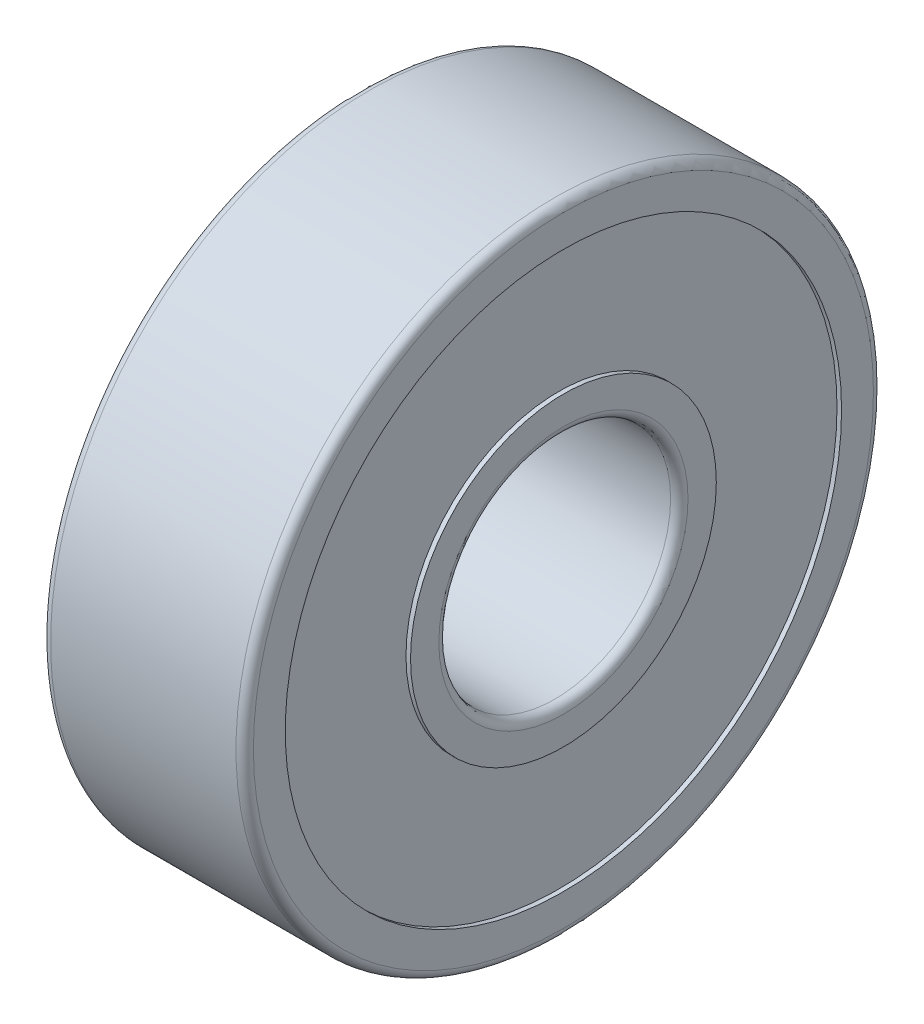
from build123d import *

# Parameters (mm, degrees)
CIRPATTERN6_COUNT  = 7
CUT_EXTRUDE2_DEPTH = 0.02


with BuildPart() as part:
    # Sketch1 → Revolve1 (revolve)
    with BuildSketch(Plane.XY, mode=Mode.PRIVATE) as revolve1_sk:
        with BuildLine():
            Line((-6.302433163, 8.80479456), (-4.872433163, 8.80479456))
            ThreePointArc((-4.872433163, 8.80479456), (-3.5, 9.35), (-2.127566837, 8.80479456))
            Line((-2.127566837, 8.80479456), (-0.697566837, 8.80479456))
            Line((-0.697566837, 8.80479456), (-0.557350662, 9.6))
            ThreePointArc((-0.557350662, 9.6), (-0.357175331, 9.800175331), (-0.157, 9.6))
            Line((-0.157, 9.6), (0, 9.6))
            Line((0, 9.6), (0, 10.7))
            ThreePointArc((0, 10.7), (-0.087867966, 10.912132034), (-0.3, 11))
            Line((-0.3, 11), (-6.7, 11))
            ThreePointArc((-6.7, 11), (-6.912132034, 10.912132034), (-7, 10.7))
            Line((-7, 10.7), (-7, 9.6))
            Line((-7, 9.6), (-6.843, 9.6))
            ThreePointArc((-6.843, 9.6), (-6.642824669, 9.800175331), (-6.442649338, 9.6))
            Line((-6.442649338, 9.6), (-6.302433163, 8.80479456))
        make_face()
        with BuildLine():
            Line((-6.39, 6.027124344), (-6.39, 5.577124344))
            ThreePointArc((-6.39, 5.577124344), (-6.477867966, 5.36499231), (-6.69, 5.277124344))
            Line((-6.69, 5.277124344), (-7, 5.277124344))
            Line((-7, 5.277124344), (-7, 4.3))
            ThreePointArc((-7, 4.3), (-6.912132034, 4.087867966), (-6.7, 4))
            Line((-6.7, 4), (-0.3, 4))
            ThreePointArc((-0.3, 4), (-0.087867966, 4.087867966), (0, 4.3))
            Line((0, 4.3), (0, 5.277124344))
            Line((0, 5.277124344), (-0.31, 5.277124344))
            ThreePointArc((-0.31, 5.277124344), (-0.522132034, 5.36499231), (-0.61, 5.577124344))
            Line((-0.61, 5.577124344), (-0.61, 6.027124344))
            Line((-0.61, 6.027124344), (-2, 6.027124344))
            ThreePointArc((-2, 6.027124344), (-3.5, 5.35), (-5, 6.027124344))
            Line((-5, 6.027124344), (-6.39, 6.027124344))
        make_face()
    revolve(revolve1_sk.sketch.rotate(Axis((0, 0, 0), (-1, 0, 0)), 90), axis=Axis((0, 0, 0), (-1, 0, 0)))

    # Sketch3 → Revolve3 (revolve)
    with BuildSketch(Plane.XY, mode=Mode.PRIVATE) as revolve3_sk:
        with BuildLine():
            Line((-0.557350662, 9.6), (-0.697566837, 8.80479456))
            Line((-0.697566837, 8.80479456), (-0.61, 6.027124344))
            Line((-0.61, 6.027124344), (-0.61, 5.577124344))
            ThreePointArc((-0.61, 5.577124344), (-0.522132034, 5.36499231), (-0.31, 5.277124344))
            Line((-0.31, 5.277124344), (-0.157, 5.277124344))
            Line((-0.157, 5.277124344), (-0.157, 9.6))
            ThreePointArc((-0.157, 9.6), (-0.357175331, 9.800175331), (-0.557350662, 9.6))
        make_face()
    revolve(revolve3_sk.sketch.rotate(Axis((-0.697566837, 0, 0), (1, 0, 0)), 270), axis=Axis((-0.697566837, 0, 0), (1, 0, 0)))

    # Sketch4 → Cut-Extrude2 (cut)
    # profile 1 of 14: a face of its own
    with BuildSketch(Plane.ZY.offset(7)):
        with BuildLine():
            Line((3.498925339, 9.681341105), (3.437336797, 9.704908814))
            add(Edge.make_bspline(
                [(3.437336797, 9.704908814), (3.441169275, 9.710432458), (3.448643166, 9.721204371), (3.460893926, 9.736151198), (3.473571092, 9.749765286), (3.487052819, 9.761704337), (3.500906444, 9.772389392), (3.515361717, 9.781536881), (3.530456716, 9.789086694), (3.545907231, 9.795338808), (3.561665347, 9.800201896), (3.577633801, 9.803439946), (3.593624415, 9.805273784), (3.609658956, 9.805659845), (3.625751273, 9.804649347), (3.641899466, 9.801971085), (3.658124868, 9.797984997), (3.668703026, 9.794195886), (3.674055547, 9.792278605)],
                knots=[0, 0, 0, 0, 1.174595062, 2.290632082, 3.37462807, 4.422261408, 5.434244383, 6.429716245, 7.406750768, 8.380126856, 9.339959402, 10.284654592, 11.223729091, 12.149473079, 13.084494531, 14.037286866, 15.006872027, 16, 16, 16, 16], degree=3))
            add(Edge.make_bspline(
                [(3.674055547, 9.792278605), (3.681694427, 9.789027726), (3.696847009, 9.782579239), (3.717925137, 9.769824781), (3.73707111, 9.754578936), (3.754157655, 9.737180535), (3.768966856, 9.718243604), (3.780847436, 9.697971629), (3.789679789, 9.676682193), (3.795332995, 9.654618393), (3.7981031, 9.632421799), (3.797871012, 9.610652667), (3.794685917, 9.589479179), (3.79022504, 9.576081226), (3.787987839, 9.569361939)],
                knots=[0, 0, 0, 0, 1.075529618, 2.133434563, 3.182952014, 4.241605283, 5.288599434, 6.292515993, 7.279198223, 8.267532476, 9.237196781, 10.171557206, 11.083006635, 12, 12, 12, 12], degree=3))
            add(Edge.make_bspline(
                [(3.787987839, 9.569361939), (3.78533567, 9.563115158), (3.780111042, 9.550809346), (3.769454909, 9.534018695), (3.756627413, 9.519308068), (3.741968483, 9.506358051), (3.725018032, 9.495662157), (3.706167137, 9.486816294), (3.685281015, 9.47981854), (3.670495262, 9.476958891), (3.662857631, 9.47548173)],
                knots=[0, 0, 0, 0, 0.989532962, 1.949325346, 2.88814075, 3.831116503, 4.79431201, 5.803350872, 6.865313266, 8, 8, 8, 8], degree=3))
            add(Edge.make_bspline(
                [(3.662857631, 9.47548173), (3.668713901, 9.469684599), (3.680224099, 9.458290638), (3.694376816, 9.438813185), (3.706313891, 9.418368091), (3.711720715, 9.403658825), (3.714420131, 9.396315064)],
                knots=[0, 0, 0, 0, 1.034439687, 2.033137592, 3.018022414, 4, 4, 4, 4], degree=3))
            add(Edge.make_bspline(
                [(3.714420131, 9.396315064), (3.71602186, 9.391085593), (3.71918229, 9.380767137), (3.722435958, 9.365088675), (3.724300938, 9.349491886), (3.724660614, 9.334019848), (3.723740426, 9.318645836), (3.721558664, 9.303427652), (3.71790681, 9.28828977), (3.714382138, 9.278490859), (3.712597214, 9.273528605)],
                knots=[0, 0, 0, 0, 1.046805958, 2.065490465, 3.061272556, 4.050548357, 5.024627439, 6.00717816, 6.990817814, 8, 8, 8, 8], degree=3))
            add(Edge.make_bspline(
                [(3.712597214, 9.273528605), (3.709003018, 9.265167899), (3.701827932, 9.248477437), (3.686969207, 9.225401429), (3.668973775, 9.204302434), (3.651568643, 9.18858561), (3.636469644, 9.177235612), (3.624663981, 9.169530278), (3.612606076, 9.162547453), (3.599995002, 9.156755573), (3.587141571, 9.151571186), (3.573768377, 9.147619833), (3.560133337, 9.144320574), (3.541499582, 9.141217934), (3.517760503, 9.13953175), (3.488990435, 9.141503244), (3.459966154, 9.146839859), (3.441171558, 9.153395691), (3.431607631, 9.15673173)],
                knots=[0, 0, 0, 0, 1.287129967, 2.569495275, 3.868983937, 5.20499013, 5.881166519, 6.542682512, 7.200676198, 7.852409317, 8.506486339, 9.161804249, 9.825287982, 10.49226503, 11.835492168, 13.184445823, 14.567260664, 16, 16, 16, 16], degree=3))
            add(Edge.make_bspline(
                [(3.431607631, 9.15673173), (3.425268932, 9.159322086), (3.412853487, 9.164395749), (3.39529777, 9.173593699), (3.379109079, 9.183895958), (3.364210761, 9.195262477), (3.350550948, 9.207627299), (3.338446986, 9.221282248), (3.327518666, 9.235893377), (3.318213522, 9.251702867), (3.310147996, 9.26841124), (3.303947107, 9.286159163), (3.299400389, 9.304744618), (3.29641723, 9.324173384), (3.294933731, 9.344469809), (3.295470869, 9.365669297), (3.297369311, 9.387731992), (3.299862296, 9.402622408), (3.301138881, 9.410247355)],
                knots=[0, 0, 0, 0, 1.047803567, 2.052305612, 3.029201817, 3.98203104, 4.917937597, 5.844933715, 6.77116754, 7.706696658, 8.648809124, 9.607066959, 10.578797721, 11.573961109, 12.613049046, 13.689613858, 14.816918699, 16, 16, 16, 16], degree=3))
            Line((3.301138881, 9.410247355), (3.360383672, 9.387460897))
            add(Edge.make_bspline(
                [(3.360383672, 9.387460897), (3.359897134, 9.382212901), (3.358949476, 9.371991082), (3.358439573, 9.3570382), (3.3586788, 9.34295527), (3.35965737, 9.329719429), (3.36163354, 9.317320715), (3.364341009, 9.305736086), (3.367784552, 9.294974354), (3.37086353, 9.28834521), (3.372362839, 9.285117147)],
                knots=[0, 0, 0, 0, 1.211539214, 2.35978377, 3.437668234, 4.448673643, 5.408394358, 6.320886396, 7.182355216, 8, 8, 8, 8], degree=3))
            add(Edge.make_bspline(
                [(3.372362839, 9.285117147), (3.374488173, 9.281241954), (3.378736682, 9.273495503), (3.386686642, 9.262890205), (3.395411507, 9.252840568), (3.405372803, 9.243792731), (3.416228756, 9.235384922), (3.428168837, 9.227801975), (3.441170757, 9.221046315), (3.450370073, 9.217253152), (3.455045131, 9.21532548)],
                knots=[0, 0, 0, 0, 0.957430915, 1.91388956, 2.867611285, 3.840238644, 4.826841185, 5.842649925, 6.903642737, 8, 8, 8, 8], degree=3))
            add(Edge.make_bspline(
                [(3.455045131, 9.21532548), (3.46043634, 9.213349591), (3.470951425, 9.20949579), (3.48699474, 9.205665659), (3.502614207, 9.203107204), (3.517974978, 9.202162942), (3.532971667, 9.202862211), (3.547674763, 9.204843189), (3.561941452, 9.208764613), (3.575795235, 9.213876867), (3.588857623, 9.220415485), (3.601047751, 9.227822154), (3.612115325, 9.236210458), (3.622289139, 9.245312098), (3.631119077, 9.255522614), (3.638877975, 9.266627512), (3.645704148, 9.278531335), (3.649233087, 9.287070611), (3.651008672, 9.291367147)],
                knots=[0, 0, 0, 0, 1.173149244, 2.288125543, 3.366364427, 4.406569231, 5.428131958, 6.432197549, 7.433199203, 8.446983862, 9.447159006, 10.415200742, 11.359477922, 12.283008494, 13.201364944, 14.112359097, 15.050233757, 16, 16, 16, 16], degree=3))
            add(Edge.make_bspline(
                [(3.651008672, 9.291367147), (3.653021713, 9.297263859), (3.657023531, 9.308986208), (3.659654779, 9.327517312), (3.659670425, 9.346370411), (3.656850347, 9.365320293), (3.65173223, 9.383877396), (3.64404808, 9.401476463), (3.633662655, 9.41763035), (3.623219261, 9.43016511), (3.613241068, 9.439571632), (3.604417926, 9.446805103), (3.594248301, 9.453986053), (3.582904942, 9.461502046), (3.570147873, 9.468814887), (3.556125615, 9.476290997), (3.540806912, 9.483777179), (3.530098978, 9.488698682), (3.524576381, 9.491236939)],
                knots=[0, 0, 0, 0, 1.124575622, 2.235596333, 3.365717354, 4.523326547, 5.688677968, 6.83774262, 7.980788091, 9.150439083, 9.777744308, 10.458040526, 11.211618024, 12.027891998, 12.917635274, 13.869097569, 14.900990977, 16, 16, 16, 16], degree=3))
            Line((3.524576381, 9.491236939), (3.545930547, 9.546705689))
            add(Edge.make_bspline(
                [(3.545930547, 9.546705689), (3.552788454, 9.54426451), (3.566237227, 9.539477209), (3.586809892, 9.534812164), (3.607097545, 9.532312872), (3.626867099, 9.531896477), (3.645572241, 9.533498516), (3.662607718, 9.537086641), (3.677764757, 9.542536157), (3.690905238, 9.550038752), (3.702154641, 9.559135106), (3.711822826, 9.569348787), (3.719673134, 9.58096943), (3.723362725, 9.5895198), (3.725227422, 9.593841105)],
                knots=[0, 0, 0, 0, 1.269445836, 2.48946076, 3.672253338, 4.831332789, 5.934000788, 6.94123057, 7.861428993, 8.733255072, 9.568380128, 10.377547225, 11.180022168, 12, 12, 12, 12], degree=3))
            add(Edge.make_bspline(
                [(3.725227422, 9.593841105), (3.72639342, 9.597116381), (3.72869131, 9.603571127), (3.730711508, 9.613600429), (3.731824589, 9.623630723), (3.731628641, 9.633717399), (3.73050807, 9.643815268), (3.728055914, 9.653906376), (3.724717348, 9.664101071), (3.720103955, 9.67415738), (3.714768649, 9.684007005), (3.708309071, 9.693191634), (3.700971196, 9.701635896), (3.69290056, 9.709588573), (3.683714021, 9.716493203), (3.67386434, 9.723008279), (3.663091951, 9.728719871), (3.655421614, 9.731840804), (3.651529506, 9.733424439)],
                knots=[0, 0, 0, 0, 0.948594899, 1.869442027, 2.787307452, 3.700335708, 4.619502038, 5.557066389, 6.531899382, 7.545544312, 8.5750827, 9.58817274, 10.605417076, 11.628380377, 12.676592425, 13.738792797, 14.852610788, 16, 16, 16, 16], degree=3))
            add(Edge.make_bspline(
                [(3.651529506, 9.733424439), (3.645118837, 9.735596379), (3.632597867, 9.739838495), (3.6131919, 9.742400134), (3.594086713, 9.741780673), (3.578486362, 9.738472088), (3.566123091, 9.734186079), (3.556822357, 9.729679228), (3.547323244, 9.724329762), (3.537855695, 9.717747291), (3.528205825, 9.710180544), (3.518453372, 9.701544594), (3.508536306, 9.691946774), (3.502184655, 9.68493775), (3.498925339, 9.681341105)],
                knots=[0, 0, 0, 0, 1.401972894, 2.738257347, 4.036102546, 5.352198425, 6.030209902, 6.747415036, 7.493724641, 8.29071287, 9.137598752, 10.037481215, 10.992943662, 12, 12, 12, 12], degree=3))
        make_face()
    # profile 2 of 14: a face of its own
    with BuildSketch(Plane.ZY.offset(7)):
        with BuildLine():
            Line((3.310557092, 9.774223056), (3.250140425, 9.752217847))
            add(Edge.make_bspline(
                [(3.250140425, 9.752217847), (3.248069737, 9.7575365), (3.243969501, 9.768068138), (3.236870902, 9.783363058), (3.229137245, 9.798066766), (3.22043455, 9.812053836), (3.211149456, 9.82548176), (3.20086901, 9.838101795), (3.190106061, 9.850279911), (3.174614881, 9.865528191), (3.153544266, 9.883037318), (3.125701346, 9.901018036), (3.095375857, 9.916075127), (3.073846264, 9.92346229), (3.062900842, 9.927217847)],
                knots=[0, 0, 0, 0, 0.772447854, 1.529549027, 2.281250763, 3.019888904, 3.758246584, 4.489557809, 5.221930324, 5.957289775, 7.430225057, 8.921374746, 10.434858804, 12, 12, 12, 12], degree=3))
            add(Edge.make_bspline(
                [(3.062900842, 9.927217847), (3.056760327, 9.929041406), (3.044619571, 9.932646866), (3.026107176, 9.936496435), (3.007680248, 9.939285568), (2.989185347, 9.940687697), (2.970702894, 9.940959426), (2.952178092, 9.940029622), (2.933637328, 9.937985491), (2.915260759, 9.93455827), (2.897172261, 9.930143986), (2.879590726, 9.924764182), (2.86277866, 9.918021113), (2.846531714, 9.910470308), (2.830906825, 9.901871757), (2.815902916, 9.892262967), (2.801665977, 9.881462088), (2.788008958, 9.869856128), (2.77528697, 9.85713158), (2.763206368, 9.843785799), (2.752353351, 9.829392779), (2.742223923, 9.814360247), (2.733103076, 9.798488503), (2.725098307, 9.781711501), (2.717674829, 9.764311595), (2.71372336, 9.752207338), (2.711728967, 9.746098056)],
                knots=[0, 0, 0, 0, 1.045823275, 2.067755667, 3.085351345, 4.087946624, 5.094693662, 6.10256323, 7.115580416, 8.13896248, 9.153392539, 10.155661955, 11.139025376, 12.109476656, 13.080342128, 14.049783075, 15.016732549, 15.997101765, 16.974596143, 17.953631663, 18.934795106, 19.915907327, 20.913024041, 21.921267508, 22.950818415, 24, 24, 24, 24], degree=3))
            add(Edge.make_bspline(
                [(2.711728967, 9.746098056), (2.709062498, 9.736811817), (2.703820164, 9.718554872), (2.699375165, 9.690817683), (2.697458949, 9.663528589), (2.698379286, 9.63664957), (2.702001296, 9.610140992), (2.708615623, 9.584113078), (2.717894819, 9.558440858), (2.729967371, 9.533531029), (2.744348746, 9.509731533), (2.760908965, 9.487730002), (2.779378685, 9.46753484), (2.800113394, 9.449648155), (2.822553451, 9.433300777), (2.847214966, 9.419316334), (2.873717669, 9.407056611), (2.892435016, 9.400743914), (2.901963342, 9.397530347)],
                knots=[0, 0, 0, 0, 1.043447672, 2.051440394, 3.02941375, 3.996354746, 4.953033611, 5.915594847, 6.893534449, 7.898564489, 8.902630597, 9.894346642, 10.870405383, 11.854525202, 12.849232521, 13.866342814, 14.913832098, 16, 16, 16, 16], degree=3))
            add(Edge.make_bspline(
                [(2.901963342, 9.397530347), (2.912627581, 9.394503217), (2.933641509, 9.388538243), (2.965790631, 9.383997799), (2.997526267, 9.382702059), (3.028952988, 9.38521376), (3.059994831, 9.39141933), (3.090697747, 9.401161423), (3.121167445, 9.41427348), (3.140447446, 9.425695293), (3.150270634, 9.431514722)],
                knots=[0, 0, 0, 0, 1.025980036, 2.021698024, 2.999465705, 3.963511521, 4.935041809, 5.925713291, 6.943147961, 8, 8, 8, 8], degree=3))
            Line((3.150270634, 9.431514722), (3.187510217, 9.379431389))
            add(Edge.make_bspline(
                [(3.187510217, 9.379431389), (3.182128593, 9.375845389), (3.171391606, 9.368690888), (3.154523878, 9.35923145), (3.137252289, 9.350719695), (3.119444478, 9.343501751), (3.101343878, 9.33698402), (3.082671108, 9.331906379), (3.063634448, 9.327480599), (3.044129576, 9.324456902), (3.024319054, 9.32231599), (3.004272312, 9.321424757), (2.984014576, 9.32169308), (2.963579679, 9.323114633), (2.942952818, 9.325799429), (2.922102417, 9.329357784), (2.901099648, 9.334384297), (2.887146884, 9.33844489), (2.880088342, 9.340499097)],
                knots=[0, 0, 0, 0, 0.966567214, 1.928417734, 2.889041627, 3.843464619, 4.799870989, 5.763449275, 6.73477531, 7.720539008, 8.712350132, 9.712721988, 10.71863495, 11.739940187, 12.773418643, 13.827472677, 14.900943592, 16, 16, 16, 16], degree=3))
            add(Edge.make_bspline(
                [(2.880088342, 9.340499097), (2.873470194, 9.342652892), (2.860397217, 9.346907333), (2.841383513, 9.354249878), (2.823091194, 9.362148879), (2.805652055, 9.370906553), (2.788959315, 9.380280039), (2.773066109, 9.390275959), (2.758040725, 9.400993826), (2.7438282, 9.412387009), (2.730223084, 9.424288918), (2.717618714, 9.437125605), (2.705735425, 9.450542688), (2.694658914, 9.464635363), (2.684317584, 9.479391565), (2.674864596, 9.494841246), (2.66618492, 9.51097873), (2.661062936, 9.522111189), (2.658473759, 9.527738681)],
                knots=[0, 0, 0, 0, 1.114139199, 2.200784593, 3.262001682, 4.303096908, 5.323649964, 6.326181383, 7.307683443, 8.276832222, 9.241736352, 10.199935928, 11.155031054, 12.1101009, 13.068224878, 14.038369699, 15.008390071, 16, 16, 16, 16], degree=3))
            add(Edge.make_bspline(
                [(2.658473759, 9.527738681), (2.654601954, 9.537352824), (2.646903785, 9.556468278), (2.638655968, 9.586106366), (2.633139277, 9.616133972), (2.630380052, 9.646556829), (2.630527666, 9.677422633), (2.63360219, 9.708698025), (2.63939655, 9.740386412), (2.645404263, 9.761289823), (2.648447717, 9.771879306)],
                knots=[0, 0, 0, 0, 0.995291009, 1.978901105, 2.949875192, 3.925540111, 4.909786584, 5.911140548, 6.941802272, 8, 8, 8, 8], degree=3))
            add(Edge.make_bspline(
                [(2.648447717, 9.771879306), (2.652191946, 9.782853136), (2.659562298, 9.804454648), (2.674001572, 9.835046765), (2.69100125, 9.863368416), (2.710594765, 9.889384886), (2.732759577, 9.913085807), (2.757393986, 9.934568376), (2.784604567, 9.95378884), (2.814158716, 9.970388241), (2.845173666, 9.984450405), (2.877200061, 9.995184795), (2.909841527, 10.0024887), (2.943028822, 10.006621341), (2.976848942, 10.007040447), (3.011218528, 10.004216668), (3.046288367, 9.998383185), (3.069381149, 9.991690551), (3.081130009, 9.988285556)],
                knots=[0, 0, 0, 0, 1.02967215, 2.026865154, 2.999136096, 3.960213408, 4.915243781, 5.877396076, 6.859689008, 7.869988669, 8.88498112, 9.881375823, 10.865665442, 11.852520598, 12.847653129, 13.865177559, 14.913871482, 16, 16, 16, 16], degree=3))
            add(Edge.make_bspline(
                [(3.081130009, 9.988285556), (3.0881884, 9.985974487), (3.10217263, 9.98139575), (3.122493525, 9.973254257), (3.142010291, 9.964349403), (3.16059258, 9.954381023), (3.178284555, 9.94353795), (3.195310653, 9.932003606), (3.211314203, 9.919326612), (3.226422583, 9.905777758), (3.240557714, 9.891481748), (3.253780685, 9.876613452), (3.265915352, 9.861088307), (3.276968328, 9.844932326), (3.28704554, 9.828211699), (3.296064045, 9.810886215), (3.303888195, 9.792837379), (3.308324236, 9.780455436), (3.310557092, 9.774223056)],
                knots=[0, 0, 0, 0, 1.092670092, 2.164820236, 3.219343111, 4.24799896, 5.265590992, 6.271815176, 7.272286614, 8.267320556, 9.25637172, 10.229121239, 11.193722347, 12.153894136, 13.107928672, 14.064887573, 15.025972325, 16, 16, 16, 16], degree=3))
        make_face()
    # profile 3 of 14: a face of its own
    with BuildSketch(Plane.ZY.offset(7)):
        Polygon((2.64179639, 10.12227701), (2.198697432, 9.457693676), (2.133332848, 9.473969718), (2.576041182, 10.13868326), align=None)
    # profile 4 of 14: a face of its own
    with BuildSketch(Plane.ZY.offset(7)):
        Polygon((1.721305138, 10.300799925), (1.78523743, 10.288430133), (1.733544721, 10.0222843), (2.056070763, 9.959654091), (2.107763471, 10.225799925), (2.171695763, 10.213299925), (2.048388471, 9.578794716), (1.98445618, 9.591294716), (2.043961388, 9.897544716), (1.721435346, 9.960174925), (1.661930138, 9.653924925), (1.597997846, 9.666294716), align=None)
    # profile 5 of 14: a face of its own
    with BuildSketch(Plane.ZY.offset(7)):
        with BuildLine():
            Line((1.103636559, 9.858498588), (1.162620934, 9.883628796))
            add(Edge.make_bspline(
                [(1.162620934, 9.883628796), (1.166251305, 9.874623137), (1.173192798, 9.857403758), (1.185454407, 9.833696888), (1.198686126, 9.813176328), (1.21309079, 9.795959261), (1.228369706, 9.781735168), (1.244853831, 9.770899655), (1.262416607, 9.763136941), (1.274794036, 9.760825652), (1.280980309, 9.759670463)],
                knots=[0, 0, 0, 0, 1.294134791, 2.47446576, 3.553133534, 4.543092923, 5.460660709, 6.325831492, 7.163245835, 8, 8, 8, 8], degree=3))
            add(Edge.make_bspline(
                [(1.280980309, 9.759670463), (1.286312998, 9.759082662), (1.296880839, 9.757917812), (1.312766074, 9.758883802), (1.328380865, 9.761432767), (1.343563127, 9.765993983), (1.357862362, 9.772295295), (1.370946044, 9.780116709), (1.38237386, 9.789626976), (1.392277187, 9.800472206), (1.400620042, 9.812356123), (1.406963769, 9.825134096), (1.411869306, 9.83838506), (1.413496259, 9.84761264), (1.414313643, 9.852248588)],
                knots=[0, 0, 0, 0, 1.068341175, 2.11714176, 3.161789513, 4.219024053, 5.269431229, 6.271604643, 7.249247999, 8.223512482, 9.193729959, 10.134534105, 11.062787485, 12, 12, 12, 12], degree=3))
            add(Edge.make_bspline(
                [(1.414313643, 9.852248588), (1.41475144, 9.857672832), (1.415632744, 9.868592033), (1.413683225, 9.885306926), (1.408772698, 9.902091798), (1.4036609, 9.912858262), (1.401032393, 9.918394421)],
                knots=[0, 0, 0, 0, 0.951318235, 1.915038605, 2.927904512, 4, 4, 4, 4], degree=3))
            add(Edge.make_bspline(
                [(1.401032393, 9.918394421), (1.398820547, 9.922456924), (1.394172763, 9.930993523), (1.385923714, 9.943876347), (1.376074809, 9.957392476), (1.364857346, 9.9717134), (1.352201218, 9.986846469), (1.338017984, 10.002671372), (1.322353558, 10.019223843), (1.311299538, 10.030353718), (1.305589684, 10.036102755)],
                knots=[0, 0, 0, 0, 0.729819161, 1.533580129, 2.411842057, 3.368226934, 4.403954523, 5.524536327, 6.721321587, 8, 8, 8, 8], degree=3))
            add(Edge.make_bspline(
                [(1.305589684, 10.036102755), (1.299878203, 10.041806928), (1.288931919, 10.052739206), (1.273676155, 10.068774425), (1.259904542, 10.083234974), (1.248204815, 10.096654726), (1.237977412, 10.108511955), (1.229656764, 10.119242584), (1.222861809, 10.128513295), (1.219391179, 10.134555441), (1.217829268, 10.13727463)],
                knots=[0, 0, 0, 0, 1.442974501, 2.765518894, 3.956720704, 5.012194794, 5.948066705, 6.755168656, 7.439779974, 8, 8, 8, 8], degree=3))
            add(Edge.make_bspline(
                [(1.217829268, 10.13727463), (1.215636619, 10.141409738), (1.211301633, 10.149585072), (1.206010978, 10.162277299), (1.201604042, 10.174982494), (1.198713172, 10.187888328), (1.196505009, 10.200787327), (1.19568473, 10.213821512), (1.195702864, 10.22693954), (1.196735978, 10.23563111), (1.197256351, 10.240009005)],
                knots=[0, 0, 0, 0, 1.052574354, 2.080996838, 3.090843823, 4.07389202, 5.053246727, 6.032211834, 7.008836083, 8, 8, 8, 8], degree=3))
            add(Edge.make_bspline(
                [(1.197256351, 10.240009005), (1.198406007, 10.246827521), (1.20067116, 10.26026195), (1.20741618, 10.279371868), (1.216114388, 10.297321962), (1.227373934, 10.313711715), (1.240691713, 10.328454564), (1.255804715, 10.341339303), (1.272921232, 10.351809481), (1.291452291, 10.360234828), (1.311142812, 10.366346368), (1.331531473, 10.369817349), (1.352371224, 10.371061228), (1.3662746, 10.369548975), (1.373298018, 10.368785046)],
                knots=[0, 0, 0, 0, 1.021383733, 2.012418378, 2.986009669, 3.96566043, 4.943225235, 5.918403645, 6.89318023, 7.901908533, 8.92361522, 9.933977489, 10.956329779, 12, 12, 12, 12], degree=3))
            add(Edge.make_bspline(
                [(1.373298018, 10.368785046), (1.380726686, 10.367516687), (1.395445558, 10.36500361), (1.416544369, 10.35760372), (1.436607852, 10.347803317), (1.452237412, 10.33717667), (1.464348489, 10.327234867), (1.473321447, 10.318365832), (1.482448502, 10.308533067), (1.491449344, 10.29736514), (1.500392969, 10.28498897), (1.509366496, 10.271425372), (1.518364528, 10.256705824), (1.524116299, 10.246367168), (1.527074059, 10.241050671)],
                knots=[0, 0, 0, 0, 1.299199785, 2.574183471, 3.84437907, 5.145500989, 5.826749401, 6.547493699, 7.321803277, 8.142244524, 9.022136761, 9.957439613, 10.949644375, 12, 12, 12, 12], degree=3))
            Line((1.527074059, 10.241050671), (1.469261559, 10.208498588))
            add(Edge.make_bspline(
                [(1.469261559, 10.208498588), (1.466852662, 10.212721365), (1.462175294, 10.220920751), (1.455062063, 10.232561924), (1.448184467, 10.243133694), (1.441470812, 10.252582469), (1.435065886, 10.26106058), (1.428636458, 10.268336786), (1.422541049, 10.274682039), (1.41460144, 10.281549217), (1.404403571, 10.288681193), (1.391366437, 10.295403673), (1.37747414, 10.300324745), (1.367775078, 10.302036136), (1.362881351, 10.30289963)],
                knots=[0, 0, 0, 0, 1.180544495, 2.292268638, 3.312542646, 4.242528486, 5.106885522, 5.891189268, 6.599264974, 7.241782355, 8.437706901, 9.61150362, 10.79486789, 12, 12, 12, 12], degree=3))
            add(Edge.make_bspline(
                [(1.362881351, 10.30289963), (1.356635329, 10.30347502), (1.344587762, 10.304584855), (1.326901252, 10.302483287), (1.310662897, 10.297024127), (1.296116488, 10.288569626), (1.283704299, 10.27760945), (1.273828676, 10.264665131), (1.266987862, 10.24973842), (1.264958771, 10.238986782), (1.263923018, 10.233498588)],
                knots=[0, 0, 0, 0, 1.112204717, 2.145262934, 3.137804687, 4.136439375, 5.114373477, 6.06138167, 7.010428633, 8, 8, 8, 8], degree=3))
            add(Edge.make_bspline(
                [(1.263923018, 10.233498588), (1.263535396, 10.230030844), (1.262756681, 10.223064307), (1.263110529, 10.212535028), (1.264431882, 10.202037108), (1.266723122, 10.191405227), (1.270797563, 10.180546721), (1.276520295, 10.169180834), (1.283798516, 10.157020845), (1.289716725, 10.149029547), (1.292829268, 10.144826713)],
                knots=[0, 0, 0, 0, 0.871341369, 1.750484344, 2.625264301, 3.514989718, 4.462390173, 5.515373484, 6.693269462, 8, 8, 8, 8], degree=3))
            add(Edge.make_bspline(
                [(1.292829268, 10.144826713), (1.293990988, 10.143428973), (1.296802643, 10.140046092), (1.302026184, 10.1344081), (1.308798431, 10.127205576), (1.317322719, 10.118625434), (1.327469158, 10.108503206), (1.339151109, 10.096790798), (1.352444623, 10.083607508), (1.361917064, 10.074417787), (1.366917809, 10.069566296)],
                knots=[0, 0, 0, 0, 0.412848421, 0.999196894, 1.745540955, 2.658956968, 3.746657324, 5.001696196, 6.417118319, 8, 8, 8, 8], degree=3))
            add(Edge.make_bspline(
                [(1.366917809, 10.069566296), (1.372905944, 10.063661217), (1.384535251, 10.052193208), (1.400729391, 10.03486892), (1.415546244, 10.018287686), (1.428799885, 10.002419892), (1.440355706, 9.987045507), (1.45034979, 9.972404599), (1.458956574, 9.958432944), (1.467944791, 9.940872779), (1.476583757, 9.919472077), (1.483044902, 9.893905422), (1.485854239, 9.86867295), (1.484336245, 9.852202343), (1.483584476, 9.844045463)],
                knots=[0, 0, 0, 0, 1.148284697, 2.23003594, 3.237542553, 4.184575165, 5.052246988, 5.862669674, 6.604669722, 7.291197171, 8.55464428, 9.746282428, 10.883872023, 12, 12, 12, 12], degree=3))
            add(Edge.make_bspline(
                [(1.483584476, 9.844045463), (1.482681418, 9.838328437), (1.480900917, 9.827056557), (1.475843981, 9.810819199), (1.469744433, 9.795221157), (1.461634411, 9.780617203), (1.452257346, 9.766655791), (1.441086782, 9.753633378), (1.428390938, 9.741356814), (1.414327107, 9.730009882), (1.399220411, 9.719910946), (1.383427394, 9.711426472), (1.367177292, 9.704581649), (1.350382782, 9.699458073), (1.333055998, 9.696107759), (1.315267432, 9.694373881), (1.296991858, 9.694541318), (1.284748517, 9.695851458), (1.278506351, 9.696519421)],
                knots=[0, 0, 0, 0, 0.988833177, 1.949616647, 2.902333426, 3.849246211, 4.800660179, 5.775116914, 6.778010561, 7.818140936, 8.862185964, 9.882004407, 10.880352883, 11.873858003, 12.880044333, 13.894415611, 14.926485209, 16, 16, 16, 16], degree=3))
            add(Edge.make_bspline(
                [(1.278506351, 9.696519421), (1.273718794, 9.697276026), (1.264208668, 9.698778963), (1.250293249, 9.702213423), (1.236803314, 9.706450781), (1.223909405, 9.711902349), (1.211375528, 9.717970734), (1.199313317, 9.725004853), (1.18790849, 9.733187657), (1.176695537, 9.741996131), (1.166104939, 9.752145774), (1.155933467, 9.763516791), (1.146169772, 9.776197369), (1.136790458, 9.790167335), (1.12786601, 9.805422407), (1.1191774, 9.821874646), (1.11121216, 9.839742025), (1.106202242, 9.852146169), (1.103636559, 9.858498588)],
                knots=[0, 0, 0, 0, 0.923697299, 1.834856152, 2.729827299, 3.616497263, 4.500963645, 5.383686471, 6.27443983, 7.175168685, 8.099940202, 9.066808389, 10.081398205, 11.148580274, 12.272541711, 13.449531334, 14.693852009, 16, 16, 16, 16], degree=3))
        make_face()
    # profile 6 of 14: a face of its own
    with BuildSketch(Plane.ZY.offset(7)):
        with BuildLine():
            Line((0.661377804, 10.425515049), (0.790153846, 10.414707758))
            add(Edge.make_bspline(
                [(0.790153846, 10.414707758), (0.798748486, 10.413936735), (0.815249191, 10.412456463), (0.838872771, 10.410173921), (0.860315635, 10.40768708), (0.879554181, 10.405131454), (0.896608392, 10.402383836), (0.91151179, 10.399676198), (0.924238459, 10.39695292), (0.931875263, 10.394655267), (0.935336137, 10.393614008)],
                knots=[0, 0, 0, 0, 1.409525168, 2.706123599, 3.87659132, 4.935386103, 5.87597841, 6.697788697, 7.409859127, 8, 8, 8, 8], degree=3))
            add(Edge.make_bspline(
                [(0.935336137, 10.393614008), (0.939969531, 10.392048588), (0.949077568, 10.388971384), (0.962023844, 10.382965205), (0.974330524, 10.376338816), (0.9859736, 10.368846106), (0.996633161, 10.360166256), (1.006559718, 10.350728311), (1.015925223, 10.340564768), (1.024264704, 10.329374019), (1.031890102, 10.31763065), (1.038103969, 10.305127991), (1.043362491, 10.292223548), (1.047454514, 10.278726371), (1.05013192, 10.264664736), (1.05164623, 10.250076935), (1.052286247, 10.235010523), (1.051579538, 10.224818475), (1.051221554, 10.219655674)],
                knots=[0, 0, 0, 0, 1.033472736, 2.031536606, 3.013048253, 3.988015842, 4.954087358, 5.914913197, 6.882944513, 7.872320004, 8.86271661, 9.83958304, 10.819548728, 11.806750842, 12.816519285, 13.841192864, 14.906452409, 16, 16, 16, 16], degree=3))
            add(Edge.make_bspline(
                [(1.051221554, 10.219655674), (1.050255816, 10.211145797), (1.048366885, 10.19450093), (1.04136081, 10.170749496), (1.031742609, 10.148726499), (1.019057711, 10.128781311), (1.003746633, 10.1109938), (0.985727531, 10.095926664), (0.965212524, 10.083542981), (0.946275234, 10.075590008), (0.929782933, 10.070578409), (0.916223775, 10.0676654), (0.901666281, 10.065308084), (0.88606543, 10.063624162), (0.869375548, 10.062732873), (0.851652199, 10.062666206), (0.832890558, 10.06316582), (0.820056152, 10.064012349), (0.813461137, 10.064447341)],
                knots=[0, 0, 0, 0, 1.271789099, 2.487551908, 3.666770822, 4.836283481, 5.989576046, 7.144313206, 8.314591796, 9.541207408, 10.188622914, 10.876247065, 11.602199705, 12.381426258, 13.209001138, 14.087011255, 15.01700248, 16, 16, 16, 16], degree=3))
            Line((0.813461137, 10.064447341), (1.020622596, 9.744265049))
            Line((1.020622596, 9.744265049), (0.940674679, 9.751035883))
            Line((0.940674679, 9.751035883), (0.733903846, 10.071218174))
            Line((0.733903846, 10.071218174), (0.696924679, 10.074212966))
            Line((0.696924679, 10.074212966), (0.671664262, 9.773561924))
            Line((0.671664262, 9.773561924), (0.607080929, 9.779030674))
            Line((0.607080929, 9.779030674), (0.661377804, 10.425515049))
        make_face()
        with BuildLine():
            Line((0.720622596, 10.356765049), (0.702133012, 10.136973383))
            Line((0.702133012, 10.136973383), (0.813330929, 10.126817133))
            add(Edge.make_bspline(
                [(0.813330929, 10.126817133), (0.818537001, 10.126394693), (0.82859329, 10.125578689), (0.843229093, 10.124911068), (0.856864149, 10.124817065), (0.869463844, 10.124992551), (0.881015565, 10.125817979), (0.891585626, 10.126933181), (0.901175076, 10.128561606), (0.912416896, 10.131527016), (0.925222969, 10.136360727), (0.938993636, 10.144427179), (0.951354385, 10.154285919), (0.961812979, 10.166185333), (0.970539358, 10.179489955), (0.977380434, 10.193873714), (0.982040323, 10.209295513), (0.983363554, 10.219973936), (0.984034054, 10.225384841)],
                knots=[0, 0, 0, 0, 1.11561003, 2.154964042, 3.128433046, 4.027883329, 4.845600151, 5.601149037, 6.297687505, 6.920552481, 8.082687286, 9.208458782, 10.316066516, 11.445496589, 12.576865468, 13.704848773, 14.83701502, 16, 16, 16, 16], degree=3))
            add(Edge.make_bspline(
                [(0.984034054, 10.225384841), (0.984294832, 10.230728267), (0.984808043, 10.241244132), (0.982560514, 10.256830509), (0.978240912, 10.271825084), (0.971753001, 10.28608987), (0.963344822, 10.299130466), (0.953374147, 10.310726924), (0.941594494, 10.320229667), (0.930597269, 10.326904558), (0.920616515, 10.331336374), (0.911882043, 10.334473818), (0.901915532, 10.337102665), (0.890820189, 10.339765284), (0.878428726, 10.342054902), (0.864843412, 10.344151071), (0.850018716, 10.345778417), (0.839764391, 10.346752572), (0.834424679, 10.347259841)],
                knots=[0, 0, 0, 0, 1.164586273, 2.291906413, 3.415443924, 4.559337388, 5.696394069, 6.790019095, 7.879744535, 8.983768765, 9.585496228, 10.259246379, 11.005694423, 11.832358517, 12.747718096, 13.753220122, 14.830039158, 16, 16, 16, 16], degree=3))
            Line((0.834424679, 10.347259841), (0.720622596, 10.356765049))
        make_face(mode=Mode.SUBTRACT)
    # profile 7 of 14: a face of its own
    with BuildSketch(Plane.ZY.offset(7)):
        with BuildLine():
            Line((0.140530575, 10.240728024), (0.078551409, 10.242550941))
            add(Edge.make_bspline(
                [(0.078551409, 10.242550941), (0.079134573, 10.250382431), (0.080278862, 10.265749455), (0.084598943, 10.288075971), (0.09041811, 10.309317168), (0.098050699, 10.329426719), (0.107746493, 10.348293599), (0.11882322, 10.36626501), (0.132184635, 10.382800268), (0.146893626, 10.398246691), (0.163018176, 10.41211054), (0.180061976, 10.424340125), (0.198147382, 10.434364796), (0.216982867, 10.442509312), (0.236681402, 10.448623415), (0.257154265, 10.452962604), (0.278543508, 10.455209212), (0.293043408, 10.45510434), (0.300426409, 10.455050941)],
                knots=[0, 0, 0, 0, 1.100413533, 2.159241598, 3.182558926, 4.186285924, 5.168902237, 6.153401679, 7.141000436, 8.143989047, 9.140827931, 10.118625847, 11.080438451, 12.034653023, 12.991368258, 13.967801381, 14.96525323, 16, 16, 16, 16], degree=3))
            add(Edge.make_bspline(
                [(0.300426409, 10.455050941), (0.307686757, 10.454658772), (0.321883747, 10.453891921), (0.34259726, 10.450587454), (0.362205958, 10.445563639), (0.380672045, 10.438575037), (0.398100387, 10.430006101), (0.414351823, 10.419517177), (0.429378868, 10.407158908), (0.44320362, 10.393297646), (0.45564408, 10.378310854), (0.466341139, 10.362482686), (0.475390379, 10.34615112), (0.482735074, 10.329241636), (0.488405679, 10.311724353), (0.492097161, 10.293554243), (0.494325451, 10.274812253), (0.494226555, 10.262131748), (0.494176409, 10.255701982)],
                knots=[0, 0, 0, 0, 1.123842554, 2.197578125, 3.237896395, 4.248982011, 5.245593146, 6.236105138, 7.233077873, 8.248787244, 9.259471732, 10.24059174, 11.198969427, 12.142923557, 13.087545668, 14.040643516, 15.006490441, 16, 16, 16, 16], degree=3))
            add(Edge.make_bspline(
                [(0.494176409, 10.255701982), (0.493585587, 10.246688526), (0.492412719, 10.228795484), (0.486516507, 10.202515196), (0.477299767, 10.177239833), (0.466954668, 10.156848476), (0.456767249, 10.140421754), (0.447249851, 10.127161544), (0.436366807, 10.112779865), (0.423949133, 10.097288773), (0.409701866, 10.081031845), (0.394129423, 10.06353666), (0.376838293, 10.045138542), (0.364681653, 10.032636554), (0.358369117, 10.026144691)],
                knots=[0, 0, 0, 0, 1.186707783, 2.355790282, 3.527838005, 4.717590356, 5.356016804, 6.068782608, 6.863467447, 7.728303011, 8.679428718, 9.706330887, 10.808974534, 12, 12, 12, 12], degree=3))
            Line((0.358369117, 10.026144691), (0.192353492, 9.857394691))
            Line((0.192353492, 9.857394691), (0.490790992, 9.848410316))
            Line((0.490790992, 9.848410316), (0.488968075, 9.786040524))
            Line((0.488968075, 9.786040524), (0.049905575, 9.799191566))
            Line((0.049905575, 9.799191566), (0.304853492, 10.058566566))
            add(Edge.make_bspline(
                [(0.304853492, 10.058566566), (0.311091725, 10.064829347), (0.323071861, 10.076856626), (0.339815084, 10.094659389), (0.355125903, 10.111001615), (0.368592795, 10.126184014), (0.380459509, 10.140072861), (0.390569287, 10.152760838), (0.39907589, 10.164201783), (0.408107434, 10.177608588), (0.416909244, 10.194022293), (0.424666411, 10.214168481), (0.429663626, 10.234985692), (0.430656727, 10.249121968), (0.431155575, 10.256222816)],
                knots=[0, 0, 0, 0, 1.323036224, 2.540808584, 3.657858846, 4.674835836, 5.578208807, 6.391914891, 7.102658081, 7.711674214, 8.810362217, 9.88174404, 10.935970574, 12, 12, 12, 12], degree=3))
            add(Edge.make_bspline(
                [(0.431155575, 10.256222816), (0.431146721, 10.260695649), (0.431129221, 10.269536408), (0.429747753, 10.282612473), (0.42678053, 10.295186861), (0.422766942, 10.307383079), (0.41741323, 10.319137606), (0.41068363, 10.330405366), (0.402734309, 10.341246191), (0.393506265, 10.351422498), (0.383450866, 10.360889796), (0.372654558, 10.369253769), (0.36117612, 10.37631533), (0.349204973, 10.382378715), (0.336529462, 10.387070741), (0.323240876, 10.390386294), (0.309410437, 10.392870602), (0.29991659, 10.39334919), (0.295087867, 10.393592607)],
                knots=[0, 0, 0, 0, 0.997943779, 1.972481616, 2.926535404, 3.876152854, 4.834181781, 5.802731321, 6.800534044, 7.829450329, 8.86432296, 9.879605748, 10.871513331, 11.867904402, 12.870164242, 13.880443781, 14.921959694, 16, 16, 16, 16], degree=3))
            add(Edge.make_bspline(
                [(0.295087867, 10.393592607), (0.290007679, 10.393585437), (0.280041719, 10.393571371), (0.265368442, 10.392193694), (0.25140289, 10.389246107), (0.237962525, 10.385259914), (0.225195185, 10.379739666), (0.213010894, 10.372948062), (0.201497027, 10.364772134), (0.190579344, 10.355464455), (0.180559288, 10.34489185), (0.171494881, 10.333225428), (0.163592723, 10.320465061), (0.156725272, 10.306609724), (0.151089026, 10.291664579), (0.146378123, 10.275653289), (0.142684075, 10.258599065), (0.141259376, 10.246776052), (0.140530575, 10.240728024)],
                knots=[0, 0, 0, 0, 1.007457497, 1.976359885, 2.916845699, 3.834675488, 4.752626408, 5.669971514, 6.596762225, 7.549269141, 8.511454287, 9.481006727, 10.474834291, 11.483615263, 12.543701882, 13.638834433, 14.792152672, 16, 16, 16, 16], degree=3))
        make_face()
    # profile 8 of 14: a face of its own
    with BuildSketch(Plane.ZY.offset(7)):
        Polygon((-0.507293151, 10.056739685), (-0.265496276, 10.066114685), (-0.263412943, 10.01259906), (-0.505209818, 10.00322406), align=None)
    # profile 9 of 14: a face of its own
    with BuildSketch(Plane.ZY.offset(7)):
        with BuildLine():
            add(Edge.make_bspline(
                [(-0.965115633, 10.105209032), (-0.959583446, 10.103089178), (-0.948808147, 10.09896024), (-0.933380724, 10.092083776), (-0.919206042, 10.084583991), (-0.905949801, 10.076950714), (-0.893869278, 10.068803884), (-0.882989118, 10.060131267), (-0.873180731, 10.051141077), (-0.864406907, 10.041753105), (-0.856670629, 10.031868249), (-0.849762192, 10.021615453), (-0.843734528, 10.010847), (-0.83855143, 9.999646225), (-0.834084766, 9.988052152), (-0.830554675, 9.975991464), (-0.827946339, 9.963443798), (-0.826863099, 9.954870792), (-0.82631355, 9.950521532)],
                knots=[0, 0, 0, 0, 1.289091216, 2.510822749, 3.672561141, 4.777310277, 5.838233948, 6.839774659, 7.802301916, 8.731203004, 9.632468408, 10.530958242, 11.418962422, 12.314767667, 13.214596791, 14.120157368, 15.046317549, 16, 16, 16, 16], degree=3))
            add(Edge.make_bspline(
                [(-0.82631355, 9.950521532), (-0.825812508, 9.944406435), (-0.824825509, 9.932360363), (-0.825269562, 9.914354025), (-0.827249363, 9.896812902), (-0.830548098, 9.87953885), (-0.835888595, 9.862779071), (-0.842518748, 9.846290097), (-0.85071953, 9.830180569), (-0.857339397, 9.819996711), (-0.86068855, 9.814844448)],
                knots=[0, 0, 0, 0, 1.029037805, 2.02709165, 3.016390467, 3.989115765, 4.972795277, 5.962817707, 6.969339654, 8, 8, 8, 8], degree=3))
            add(Edge.make_bspline(
                [(-0.86068855, 9.814844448), (-0.865129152, 9.808720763), (-0.873954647, 9.796550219), (-0.889993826, 9.780722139), (-0.907503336, 9.766555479), (-0.927080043, 9.754773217), (-0.948353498, 9.744758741), (-0.971480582, 9.736934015), (-0.99638564, 9.730784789), (-1.013739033, 9.728599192), (-1.022667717, 9.727474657)],
                knots=[0, 0, 0, 0, 0.953004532, 1.894052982, 2.833187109, 3.789365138, 4.76936879, 5.794692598, 6.865323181, 8, 8, 8, 8], degree=3))
            add(Edge.make_bspline(
                [(-1.022667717, 9.727474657), (-1.031297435, 9.726719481), (-1.048016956, 9.725256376), (-1.072554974, 9.725545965), (-1.095704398, 9.72784014), (-1.117510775, 9.732189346), (-1.137865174, 9.73880156), (-1.156930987, 9.747201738), (-1.17444489, 9.75799829), (-1.190430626, 9.770641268), (-1.204700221, 9.784668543), (-1.217519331, 9.799309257), (-1.228864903, 9.814389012), (-1.238195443, 9.83027564), (-1.246151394, 9.846598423), (-1.252181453, 9.863612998), (-1.256940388, 9.881089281), (-1.258482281, 9.89307355), (-1.259256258, 9.89908924)],
                knots=[0, 0, 0, 0, 1.269524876, 2.459622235, 3.59182311, 4.676378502, 5.712817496, 6.724040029, 7.723783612, 8.720646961, 9.706213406, 10.653286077, 11.572231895, 12.468262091, 13.350629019, 14.230329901, 15.11168652, 16, 16, 16, 16], degree=3))
            add(Edge.make_bspline(
                [(-1.259256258, 9.89908924), (-1.259608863, 9.903513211), (-1.260306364, 9.912264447), (-1.260491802, 9.925321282), (-1.259529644, 9.938157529), (-1.257732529, 9.950736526), (-1.255004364, 9.963119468), (-1.251152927, 9.975169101), (-1.246659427, 9.987113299), (-1.240966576, 9.998747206), (-1.234352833, 10.010249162), (-1.22645277, 10.021519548), (-1.217290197, 10.032599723), (-1.206877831, 10.043506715), (-1.195211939, 10.054183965), (-1.182410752, 10.064769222), (-1.168347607, 10.075166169), (-1.15837533, 10.081772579), (-1.153266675, 10.085156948)],
                knots=[0, 0, 0, 0, 0.937445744, 1.854399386, 2.755258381, 3.653874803, 4.537014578, 5.430235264, 6.324208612, 7.230510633, 8.163100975, 9.124587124, 10.134227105, 11.197840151, 12.307450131, 13.473221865, 14.705567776, 16, 16, 16, 16], degree=3))
            add(Edge.make_bspline(
                [(-1.153266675, 10.085156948), (-1.161175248, 10.088476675), (-1.176470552, 10.094897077), (-1.197237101, 10.107485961), (-1.215371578, 10.121635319), (-1.230604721, 10.137635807), (-1.242911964, 10.155045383), (-1.252364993, 10.173491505), (-1.258962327, 10.192947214), (-1.260975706, 10.206380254), (-1.261990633, 10.21315174)],
                knots=[0, 0, 0, 0, 1.16143992, 2.246242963, 3.280995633, 4.271557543, 5.229874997, 6.161445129, 7.073199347, 8, 8, 8, 8], degree=3))
            add(Edge.make_bspline(
                [(-1.261990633, 10.21315174), (-1.262428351, 10.22014235), (-1.263306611, 10.234168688), (-1.260592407, 10.255418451), (-1.254905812, 10.276677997), (-1.246234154, 10.297775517), (-1.234575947, 10.317983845), (-1.220158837, 10.336641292), (-1.203002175, 10.353289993), (-1.183532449, 10.367940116), (-1.162067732, 10.380233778), (-1.139267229, 10.390088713), (-1.115124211, 10.396964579), (-1.098529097, 10.399324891), (-1.090115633, 10.400521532)],
                knots=[0, 0, 0, 0, 0.893648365, 1.793064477, 2.722952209, 3.700680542, 4.699863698, 5.696394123, 6.704669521, 7.746574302, 8.802869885, 9.859165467, 10.914630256, 12, 12, 12, 12], degree=3))
            add(Edge.make_bspline(
                [(-1.090115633, 10.400521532), (-1.08187122, 10.40113071), (-1.065585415, 10.402334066), (-1.041306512, 10.400316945), (-1.017607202, 10.395700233), (-0.994855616, 10.387845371), (-0.973360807, 10.377485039), (-0.953728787, 10.364692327), (-0.936130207, 10.349559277), (-0.921098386, 10.332133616), (-0.908302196, 10.313392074), (-0.898423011, 10.293519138), (-0.891428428, 10.272788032), (-0.889338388, 10.258467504), (-0.888292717, 10.251302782)],
                knots=[0, 0, 0, 0, 1.067609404, 2.108928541, 3.139222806, 4.182883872, 5.212092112, 6.21775328, 7.204600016, 8.203046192, 9.185333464, 10.131635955, 11.065236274, 12, 12, 12, 12], degree=3))
            add(Edge.make_bspline(
                [(-0.888292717, 10.251302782), (-0.887751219, 10.244183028), (-0.88669206, 10.230256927), (-0.889171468, 10.209595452), (-0.894103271, 10.189767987), (-0.902546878, 10.170969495), (-0.913759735, 10.153047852), (-0.928031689, 10.136065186), (-0.9451923, 10.119792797), (-0.95831527, 10.110186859), (-0.965115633, 10.105209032)],
                knots=[0, 0, 0, 0, 0.982145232, 1.921056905, 2.854174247, 3.789131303, 4.74870988, 5.759930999, 6.839189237, 8, 8, 8, 8], degree=3))
        make_face()
        with BuildLine():
            add(Edge.make_bspline(
                [(-1.0864698, 10.338021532), (-1.090737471, 10.337496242), (-1.099166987, 10.336458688), (-1.111332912, 10.333512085), (-1.122894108, 10.329892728), (-1.133797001, 10.325353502), (-1.143919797, 10.319675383), (-1.153567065, 10.313320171), (-1.16236033, 10.305823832), (-1.170575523, 10.297696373), (-1.177742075, 10.288920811), (-1.184010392, 10.279882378), (-1.188938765, 10.270443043), (-1.192862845, 10.260765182), (-1.195814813, 10.250884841), (-1.197310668, 10.240677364), (-1.19788744, 10.23024876), (-1.197395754, 10.22321988), (-1.197146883, 10.219662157)],
                knots=[0, 0, 0, 0, 1.143739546, 2.259117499, 3.326051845, 4.366766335, 5.395807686, 6.411597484, 7.436739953, 8.466105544, 9.483864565, 10.448427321, 11.389028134, 12.311574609, 13.225690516, 14.126049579, 15.051485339, 16, 16, 16, 16], degree=3))
            add(Edge.make_bspline(
                [(-1.197146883, 10.219662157), (-1.196676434, 10.216127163), (-1.19574675, 10.209141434), (-1.192707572, 10.199014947), (-1.188891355, 10.189150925), (-1.183573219, 10.179795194), (-1.177295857, 10.170776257), (-1.169957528, 10.162065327), (-1.161297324, 10.153948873), (-1.151779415, 10.146162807), (-1.141459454, 10.139252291), (-1.130793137, 10.133186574), (-1.119772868, 10.128380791), (-1.108554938, 10.124547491), (-1.097031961, 10.121923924), (-1.085252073, 10.12054963), (-1.073217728, 10.120061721), (-1.065156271, 10.120747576), (-1.061079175, 10.121094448)],
                knots=[0, 0, 0, 0, 0.922653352, 1.823314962, 2.731807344, 3.658154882, 4.60349288, 5.576979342, 6.603158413, 7.67462412, 8.760163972, 9.817607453, 10.849931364, 11.870672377, 12.885634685, 13.905383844, 14.940644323, 16, 16, 16, 16], degree=3))
            add(Edge.make_bspline(
                [(-1.061079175, 10.121094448), (-1.05584009, 10.121814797), (-1.045465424, 10.123241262), (-1.030430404, 10.127992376), (-1.016075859, 10.134487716), (-1.002572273, 10.142874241), (-0.990056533, 10.152640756), (-0.979221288, 10.16403138), (-0.970104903, 10.176692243), (-0.96291353, 10.190416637), (-0.957528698, 10.204654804), (-0.953697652, 10.218894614), (-0.952256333, 10.233096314), (-0.952758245, 10.242405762), (-0.953006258, 10.247005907)],
                knots=[0, 0, 0, 0, 1.035710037, 2.050958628, 3.079646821, 4.119268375, 5.161674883, 6.185348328, 7.191849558, 8.212473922, 9.214898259, 10.172996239, 11.09720934, 12, 12, 12, 12], degree=3))
            add(Edge.make_bspline(
                [(-0.953006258, 10.247005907), (-0.953460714, 10.250187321), (-0.954366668, 10.256529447), (-0.956912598, 10.265809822), (-0.960277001, 10.274872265), (-0.964740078, 10.283574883), (-0.970124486, 10.292008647), (-0.976561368, 10.300057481), (-0.983846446, 10.307880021), (-0.99203315, 10.315298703), (-1.001025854, 10.322053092), (-1.010953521, 10.3277351), (-1.021678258, 10.332251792), (-1.033127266, 10.335829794), (-1.045426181, 10.337974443), (-1.058403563, 10.339106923), (-1.072213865, 10.339292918), (-1.081612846, 10.338454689), (-1.0864698, 10.338021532)],
                knots=[0, 0, 0, 0, 0.854327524, 1.703095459, 2.554608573, 3.422256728, 4.2999906, 5.212585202, 6.160376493, 7.141491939, 8.148499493, 9.146861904, 10.176460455, 11.239453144, 12.331224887, 13.490705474, 14.703314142, 16, 16, 16, 16], degree=3))
        make_face(mode=Mode.SUBTRACT)
        with BuildLine():
            add(Edge.make_bspline(
                [(-1.054047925, 10.06315174), (-1.059447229, 10.062471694), (-1.070072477, 10.061133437), (-1.085495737, 10.057413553), (-1.10013001, 10.052517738), (-1.113866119, 10.046180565), (-1.126861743, 10.03875762), (-1.139019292, 10.029966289), (-1.150391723, 10.019923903), (-1.160715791, 10.008657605), (-1.169794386, 9.996615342), (-1.177964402, 9.984368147), (-1.184258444, 9.971575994), (-1.189276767, 9.958547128), (-1.192979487, 9.945305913), (-1.195041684, 9.931671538), (-1.195753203, 9.917785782), (-1.195034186, 9.908461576), (-1.194672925, 9.90377674)],
                knots=[0, 0, 0, 0, 1.105488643, 2.175482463, 3.218957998, 4.237556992, 5.245439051, 6.256713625, 7.281749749, 8.324516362, 9.35681697, 10.345477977, 11.312164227, 12.247751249, 13.180964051, 14.100607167, 15.045672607, 16, 16, 16, 16], degree=3))
            add(Edge.make_bspline(
                [(-1.194672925, 9.90377674), (-1.193795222, 9.897968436), (-1.192056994, 9.886465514), (-1.186526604, 9.869753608), (-1.178683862, 9.853878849), (-1.168635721, 9.838890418), (-1.156646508, 9.825242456), (-1.142593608, 9.813514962), (-1.126920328, 9.803722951), (-1.109614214, 9.796007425), (-1.090859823, 9.790564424), (-1.070926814, 9.78734253), (-1.049816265, 9.786411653), (-1.035509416, 9.787559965), (-1.028136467, 9.78815174)],
                knots=[0, 0, 0, 0, 0.931365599, 1.844501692, 2.781434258, 3.735196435, 4.701818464, 5.65565533, 6.630861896, 7.627265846, 8.654368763, 9.722742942, 10.826429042, 12, 12, 12, 12], degree=3))
            add(Edge.make_bspline(
                [(-1.028136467, 9.78815174), (-1.022433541, 9.788876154), (-1.011337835, 9.790285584), (-0.995323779, 9.794028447), (-0.980278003, 9.798756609), (-0.966361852, 9.804921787), (-0.95339847, 9.812120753), (-0.941540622, 9.820618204), (-0.930655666, 9.830296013), (-0.920969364, 9.841104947), (-0.912378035, 9.852590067), (-0.905298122, 9.864645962), (-0.899140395, 9.876780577), (-0.894565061, 9.889370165), (-0.891478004, 9.902268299), (-0.889632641, 9.915434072), (-0.889066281, 9.928876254), (-0.889763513, 9.937894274), (-0.890115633, 9.942448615)],
                knots=[0, 0, 0, 0, 1.191519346, 2.318239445, 3.405657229, 4.45762592, 5.469190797, 6.475817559, 7.476753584, 8.483702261, 9.481070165, 10.445899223, 11.379833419, 12.29960568, 13.216554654, 14.125471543, 15.053312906, 16, 16, 16, 16], degree=3))
            add(Edge.make_bspline(
                [(-0.890115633, 9.942448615), (-0.890717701, 9.946848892), (-0.89191103, 9.955570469), (-0.895309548, 9.96826772), (-0.900238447, 9.980356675), (-0.906353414, 9.991983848), (-0.913840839, 10.003092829), (-0.922576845, 10.013676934), (-0.932757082, 10.023639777), (-0.944058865, 10.032969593), (-0.956132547, 10.041542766), (-0.96888486, 10.048748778), (-0.982032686, 10.054651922), (-0.995667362, 10.059070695), (-1.009660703, 10.062210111), (-1.024085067, 10.064052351), (-1.038966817, 10.06448292), (-1.048974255, 10.063599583), (-1.054047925, 10.06315174)],
                knots=[0, 0, 0, 0, 0.94537417, 1.873780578, 2.79051428, 3.720989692, 4.667131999, 5.638941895, 6.639139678, 7.696170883, 8.758002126, 9.788876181, 10.811091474, 11.822632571, 12.836410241, 13.861547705, 14.915826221, 16, 16, 16, 16], degree=3))
        make_face(mode=Mode.SUBTRACT)
    # profile 10 of 14: a face of its own
    with BuildSketch(Plane.ZY.offset(7)):
        with BuildLine():
            add(Edge.make_bspline(
                [(-1.788311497, 9.964286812), (-1.789919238, 9.974561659), (-1.793039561, 9.994503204), (-1.796123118, 10.0237181), (-1.798687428, 10.051224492), (-1.799613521, 10.077123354), (-1.799804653, 10.101374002), (-1.798364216, 10.123914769), (-1.796361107, 10.144868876), (-1.792719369, 10.164232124), (-1.788308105, 10.182323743), (-1.782970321, 10.199338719), (-1.776645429, 10.215385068), (-1.76975356, 10.230621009), (-1.761681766, 10.244803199), (-1.752837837, 10.258064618), (-1.743233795, 10.27051815), (-1.732604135, 10.281847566), (-1.721368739, 10.292200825), (-1.709512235, 10.301534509), (-1.697203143, 10.309895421), (-1.684227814, 10.317052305), (-1.670749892, 10.32323839), (-1.656704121, 10.328248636), (-1.642145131, 10.332398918), (-1.632166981, 10.334205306), (-1.627113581, 10.335120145)],
                knots=[0, 0, 0, 0, 1.645617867, 3.193835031, 4.648465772, 6.016507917, 7.29414848, 8.484475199, 9.589707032, 10.62310311, 11.599376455, 12.535709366, 13.442656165, 14.327802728, 15.179812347, 16.02187875, 16.849048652, 17.665568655, 18.477423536, 19.264849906, 20.051676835, 20.829608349, 21.607297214, 22.396040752, 23.187680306, 24, 24, 24, 24], degree=3))
            add(Edge.make_bspline(
                [(-1.627113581, 10.335120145), (-1.621957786, 10.335868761), (-1.611768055, 10.337348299), (-1.596430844, 10.337849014), (-1.581276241, 10.337595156), (-1.566319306, 10.335783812), (-1.551523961, 10.333150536), (-1.537007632, 10.329016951), (-1.522649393, 10.323793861), (-1.508476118, 10.31744762), (-1.494654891, 10.309839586), (-1.481187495, 10.301184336), (-1.468382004, 10.290963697), (-1.45589443, 10.27974392), (-1.444050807, 10.267098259), (-1.432522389, 10.253432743), (-1.421638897, 10.238415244), (-1.411156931, 10.222188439), (-1.401169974, 10.204505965), (-1.391984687, 10.185130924), (-1.383575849, 10.164034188), (-1.375577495, 10.141397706), (-1.368491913, 10.116983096), (-1.361998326, 10.090919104), (-1.356121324, 10.063167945), (-1.352870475, 10.044030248), (-1.351202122, 10.034208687)],
                knots=[0, 0, 0, 0, 0.818021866, 1.616709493, 2.40811317, 3.19742758, 3.98130164, 4.767309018, 5.56558887, 6.380648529, 7.204732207, 8.042752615, 8.892759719, 9.776359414, 10.678505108, 11.612867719, 12.584136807, 13.590567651, 14.647165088, 15.772843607, 16.957001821, 18.214522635, 19.543912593, 20.949925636, 22.434686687, 24, 24, 24, 24], degree=3))
            add(Edge.make_bspline(
                [(-1.351202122, 10.034208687), (-1.349682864, 10.024411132), (-1.346718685, 10.00529542), (-1.343838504, 9.97717083), (-1.341793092, 9.950472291), (-1.340974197, 9.925140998), (-1.341396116, 9.901204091), (-1.34268706, 9.878625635), (-1.345481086, 9.857506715), (-1.349212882, 9.837708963), (-1.354109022, 9.8191824), (-1.359670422, 9.801631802), (-1.366197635, 9.785059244), (-1.373580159, 9.769408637), (-1.381944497, 9.754813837), (-1.391089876, 9.741163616), (-1.401115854, 9.728547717), (-1.411933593, 9.716894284), (-1.42353704, 9.706443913), (-1.435549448, 9.696804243), (-1.448215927, 9.688373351), (-1.461363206, 9.68088939), (-1.475117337, 9.674648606), (-1.489387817, 9.669417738), (-1.504176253, 9.66519648), (-1.514334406, 9.663376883), (-1.519431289, 9.662463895)],
                knots=[0, 0, 0, 0, 1.558938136, 3.041597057, 4.444580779, 5.769375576, 7.025448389, 8.208657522, 9.323652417, 10.373149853, 11.374743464, 12.335308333, 13.266918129, 14.173692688, 15.054165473, 15.909843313, 16.755168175, 17.585815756, 18.407213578, 19.208833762, 20.005820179, 20.797410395, 21.585431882, 22.377933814, 23.18612346, 24, 24, 24, 24], degree=3))
            add(Edge.make_bspline(
                [(-1.519431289, 9.662463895), (-1.524501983, 9.661791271), (-1.53452812, 9.66046131), (-1.549592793, 9.659615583), (-1.56447329, 9.66024274), (-1.579214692, 9.66168361), (-1.593683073, 9.664656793), (-1.607975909, 9.668543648), (-1.622041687, 9.673635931), (-1.635847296, 9.679891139), (-1.649343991, 9.687319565), (-1.662280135, 9.696098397), (-1.674919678, 9.705808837), (-1.686682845, 9.717086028), (-1.698399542, 9.729084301), (-1.709282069, 9.742601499), (-1.719686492, 9.757253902), (-1.729847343, 9.773043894), (-1.739249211, 9.790556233), (-1.748084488, 9.80981771), (-1.756217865, 9.830989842), (-1.763947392, 9.853948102), (-1.770894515, 9.878879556), (-1.777408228, 9.905665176), (-1.783237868, 9.934344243), (-1.786588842, 9.954120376), (-1.788311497, 9.964286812)],
                knots=[0, 0, 0, 0, 0.81000562, 1.601600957, 2.385729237, 3.166868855, 3.94473502, 4.721871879, 5.511195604, 6.311074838, 7.120292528, 7.947728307, 8.785154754, 9.641137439, 10.526001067, 11.439634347, 12.385764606, 13.371663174, 14.411288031, 15.530899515, 16.725745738, 18.001754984, 19.366170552, 20.823347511, 22.366959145, 24, 24, 24, 24], degree=3))
        make_face()
        with BuildLine():
            add(Edge.make_bspline(
                [(-1.727634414, 9.972620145), (-1.726154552, 9.96384582), (-1.723291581, 9.946870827), (-1.718500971, 9.92236787), (-1.713311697, 9.899649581), (-1.707691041, 9.878691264), (-1.701904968, 9.859367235), (-1.695655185, 9.841825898), (-1.689223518, 9.825988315), (-1.68222869, 9.811885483), (-1.674833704, 9.79915912), (-1.667231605, 9.787361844), (-1.658901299, 9.776691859), (-1.650415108, 9.76670387), (-1.641174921, 9.757880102), (-1.631749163, 9.749750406), (-1.62175685, 9.742659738), (-1.608076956, 9.734686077), (-1.590610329, 9.726722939), (-1.569105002, 9.720988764), (-1.547605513, 9.718412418), (-1.53348943, 9.720004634), (-1.526462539, 9.720797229)],
                knots=[0, 0, 0, 0, 1.48185885, 2.866834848, 4.157353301, 5.361890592, 6.480026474, 7.515684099, 8.46203105, 9.325132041, 10.134726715, 10.912593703, 11.660043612, 12.387622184, 13.09303282, 13.785322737, 14.459217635, 15.129887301, 16.420851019, 17.641224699, 18.825817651, 20, 20, 20, 20], degree=3))
            add(Edge.make_bspline(
                [(-1.526462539, 9.720797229), (-1.519488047, 9.72224317), (-1.505588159, 9.725124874), (-1.485876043, 9.733936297), (-1.467537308, 9.74602749), (-1.453658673, 9.758761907), (-1.443291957, 9.770320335), (-1.436351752, 9.780156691), (-1.429870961, 9.790637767), (-1.424197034, 9.801932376), (-1.419206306, 9.814036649), (-1.414964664, 9.826930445), (-1.411247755, 9.840605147), (-1.409510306, 9.850079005), (-1.408623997, 9.854911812)],
                knots=[0, 0, 0, 0, 1.338176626, 2.666933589, 4.036252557, 5.459780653, 6.201042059, 6.956454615, 7.723278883, 8.520182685, 9.333804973, 10.186794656, 11.075047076, 12, 12, 12, 12], degree=3))
            add(Edge.make_bspline(
                [(-1.408623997, 9.854911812), (-1.407585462, 9.861020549), (-1.405465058, 9.873492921), (-1.403826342, 9.892734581), (-1.402717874, 9.912665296), (-1.402614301, 9.933349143), (-1.403457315, 9.954756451), (-1.404949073, 9.976963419), (-1.407632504, 9.999879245), (-1.409928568, 10.015377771), (-1.411097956, 10.023271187)],
                knots=[0, 0, 0, 0, 0.87880494, 1.794279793, 2.737763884, 3.710771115, 4.727537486, 5.777027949, 6.867837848, 8, 8, 8, 8], degree=3))
            add(Edge.make_bspline(
                [(-1.411097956, 10.023271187), (-1.412378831, 10.031138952), (-1.414885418, 10.04653565), (-1.419640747, 10.06887197), (-1.424719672, 10.090016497), (-1.430109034, 10.110001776), (-1.436245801, 10.128757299), (-1.442906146, 10.146328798), (-1.449852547, 10.162773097), (-1.457454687, 10.177906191), (-1.465410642, 10.19190109), (-1.473747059, 10.204820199), (-1.482398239, 10.216642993), (-1.491457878, 10.227299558), (-1.500847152, 10.236794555), (-1.510468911, 10.245340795), (-1.520527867, 10.252695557), (-1.534280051, 10.260644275), (-1.55159317, 10.268627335), (-1.57287884, 10.27438317), (-1.594164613, 10.27695784), (-1.608150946, 10.275367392), (-1.615134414, 10.27457327)],
                knots=[0, 0, 0, 0, 1.328462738, 2.599713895, 3.80514267, 4.952926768, 6.04874052, 7.092728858, 8.084426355, 9.022648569, 9.913664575, 10.76647646, 11.583977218, 12.353735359, 13.095482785, 13.808009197, 14.496782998, 15.16800946, 16.453445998, 17.66087023, 18.832057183, 20, 20, 20, 20], degree=3))
            add(Edge.make_bspline(
                [(-1.615134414, 10.27457327), (-1.622108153, 10.27307834), (-1.636052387, 10.270089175), (-1.655859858, 10.26117662), (-1.674351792, 10.248899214), (-1.688461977, 10.236077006), (-1.698771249, 10.224235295), (-1.705954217, 10.21443192), (-1.7124208, 10.203863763), (-1.718390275, 10.192613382), (-1.723367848, 10.180487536), (-1.727801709, 10.167707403), (-1.731635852, 10.154205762), (-1.73461389, 10.139759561), (-1.736861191, 10.124154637), (-1.738073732, 10.10710215), (-1.738607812, 10.08855089), (-1.738160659, 10.068392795), (-1.736847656, 10.046676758), (-1.734554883, 10.023371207), (-1.731616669, 9.998480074), (-1.728990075, 9.98142352), (-1.727634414, 9.972620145)],
                knots=[0, 0, 0, 0, 1.185178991, 2.369806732, 3.590796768, 4.870136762, 5.531119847, 6.203429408, 6.89152583, 7.593158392, 8.322148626, 9.071986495, 9.845493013, 10.657847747, 11.526798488, 12.469307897, 13.50341878, 14.616852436, 15.826210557, 17.125973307, 18.51663271, 20, 20, 20, 20], degree=3))
        make_face(mode=Mode.SUBTRACT)
    # profile 11 of 14: a face of its own
    with BuildSketch(Plane.ZY.offset(7)):
        with BuildLine():
            Line((-2.070151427, 10.256904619), (-2.010646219, 10.23411816))
            Line((-2.010646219, 10.23411816), (-2.126271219, 9.937633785))
            add(Edge.make_bspline(
                [(-2.126271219, 9.937633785), (-2.121015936, 9.940617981), (-2.110726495, 9.946460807), (-2.095025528, 9.953715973), (-2.079544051, 9.959491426), (-2.069138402, 9.96203602), (-2.064031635, 9.963284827)],
                knots=[0, 0, 0, 0, 1.072431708, 2.09973917, 3.067411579, 4, 4, 4, 4], degree=3))
            add(Edge.make_bspline(
                [(-2.064031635, 9.963284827), (-2.057800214, 9.964467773), (-2.045537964, 9.966795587), (-2.027063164, 9.967812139), (-2.009004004, 9.967420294), (-1.991264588, 9.964911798), (-1.973941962, 9.960397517), (-1.956868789, 9.954315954), (-1.940268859, 9.946102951), (-1.924166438, 9.93628044), (-1.908813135, 9.925112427), (-1.89502149, 9.91232648), (-1.882449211, 9.898696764), (-1.871372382, 9.88386161), (-1.862051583, 9.867761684), (-1.854062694, 9.850600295), (-1.847478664, 9.832299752), (-1.844382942, 9.819524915), (-1.842807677, 9.81302441)],
                knots=[0, 0, 0, 0, 1.02094507, 2.009025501, 2.974524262, 3.927942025, 4.887979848, 5.854718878, 6.843071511, 7.86614612, 8.891417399, 9.896259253, 10.891220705, 11.875904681, 12.872634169, 13.883227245, 14.922875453, 16, 16, 16, 16], degree=3))
            add(Edge.make_bspline(
                [(-1.842807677, 9.81302441), (-1.841173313, 9.804025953), (-1.837961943, 9.786344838), (-1.837415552, 9.759598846), (-1.840277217, 9.733557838), (-1.846512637, 9.708299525), (-1.856205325, 9.684333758), (-1.86895037, 9.661768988), (-1.884959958, 9.640962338), (-1.903974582, 9.622219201), (-1.925162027, 9.605717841), (-1.948308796, 9.592181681), (-1.973096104, 9.581713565), (-1.990523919, 9.577340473), (-1.999318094, 9.575133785)],
                knots=[0, 0, 0, 0, 1.035600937, 2.034857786, 3.02009395, 3.998770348, 4.974708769, 5.942149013, 6.928367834, 7.940949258, 8.961676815, 9.965177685, 10.973217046, 12, 12, 12, 12], degree=3))
            add(Edge.make_bspline(
                [(-1.999318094, 9.575133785), (-2.007928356, 9.573591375), (-2.025011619, 9.570531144), (-2.050959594, 9.570199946), (-2.076644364, 9.572900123), (-2.10178603, 9.579006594), (-2.125914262, 9.588337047), (-2.148355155, 9.600932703), (-2.168903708, 9.61667251), (-2.187370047, 9.635158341), (-2.203345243, 9.6560055), (-2.216601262, 9.678480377), (-2.226830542, 9.702575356), (-2.231130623, 9.719466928), (-2.233302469, 9.727998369)],
                knots=[0, 0, 0, 0, 1.010236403, 2.004368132, 2.988897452, 3.990918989, 4.987443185, 5.971857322, 6.956783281, 7.971958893, 8.985034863, 9.986301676, 10.982939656, 12, 12, 12, 12], degree=3))
            add(Edge.make_bspline(
                [(-2.233302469, 9.727998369), (-2.234533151, 9.734620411), (-2.237028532, 9.748047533), (-2.238099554, 9.768960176), (-2.237779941, 9.790726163), (-2.235370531, 9.813831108), (-2.230454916, 9.838781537), (-2.223271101, 9.866286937), (-2.213220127, 9.89650921), (-2.205220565, 9.917396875), (-2.201010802, 9.928388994)],
                knots=[0, 0, 0, 0, 0.783933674, 1.589535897, 2.4341393, 3.318698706, 4.291595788, 5.394209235, 6.62870448, 8, 8, 8, 8], degree=3))
            Line((-2.201010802, 9.928388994), (-2.070151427, 10.256904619))
        make_face()
        with BuildLine():
            add(Edge.make_bspline(
                [(-2.067286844, 9.90443066), (-2.071784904, 9.90335318), (-2.08065366, 9.901228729), (-2.093315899, 9.896450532), (-2.105242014, 9.890678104), (-2.116506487, 9.883971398), (-2.126860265, 9.875877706), (-2.136504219, 9.86681022), (-2.145286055, 9.856497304), (-2.153250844, 9.845297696), (-2.160277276, 9.833448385), (-2.165890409, 9.821119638), (-2.170226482, 9.808565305), (-2.173234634, 9.795738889), (-2.174933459, 9.782693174), (-2.175293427, 9.769395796), (-2.174464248, 9.755811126), (-2.172726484, 9.746777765), (-2.171844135, 9.742191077)],
                knots=[0, 0, 0, 0, 1.033340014, 2.037420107, 3.018347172, 3.993641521, 4.962250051, 5.950780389, 6.948650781, 7.985402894, 9.02065507, 10.02379677, 11.008939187, 11.985825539, 12.964445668, 13.945036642, 14.956592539, 16, 16, 16, 16], degree=3))
            add(Edge.make_bspline(
                [(-2.171844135, 9.742191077), (-2.170769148, 9.73769168), (-2.168649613, 9.72882029), (-2.163821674, 9.716140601), (-2.158176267, 9.704143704), (-2.151287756, 9.692953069), (-2.143393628, 9.68248632), (-2.134125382, 9.672987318), (-2.123965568, 9.664045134), (-2.112707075, 9.656096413), (-2.100830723, 9.649095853), (-2.088599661, 9.64332764), (-2.07607014, 9.638974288), (-2.063323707, 9.635998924), (-2.050281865, 9.634269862), (-2.037025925, 9.6339249), (-2.023484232, 9.634752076), (-2.014538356, 9.636490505), (-2.009995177, 9.637373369)],
                knots=[0, 0, 0, 0, 1.034425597, 2.039560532, 3.030273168, 3.998291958, 4.975625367, 5.958159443, 6.96343521, 8.00127649, 9.037616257, 10.045891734, 11.022887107, 12.000799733, 12.970815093, 13.962146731, 14.965072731, 16, 16, 16, 16], degree=3))
            add(Edge.make_bspline(
                [(-2.009995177, 9.637373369), (-2.005497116, 9.638450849), (-1.996628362, 9.6405753), (-1.983966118, 9.645353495), (-1.97204002, 9.651125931), (-1.960775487, 9.657832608), (-1.950421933, 9.665926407), (-1.940777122, 9.674993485), (-1.931998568, 9.685307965), (-1.924021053, 9.696501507), (-1.917032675, 9.7083891), (-1.911261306, 9.72061725), (-1.906908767, 9.733147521), (-1.903933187, 9.745893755), (-1.902204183, 9.75893565), (-1.901859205, 9.772191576), (-1.902686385, 9.785733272), (-1.904424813, 9.794679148), (-1.905307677, 9.799222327)],
                knots=[0, 0, 0, 0, 1.034909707, 2.040515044, 3.022932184, 3.99970805, 4.969787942, 5.959819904, 6.959206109, 7.997533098, 9.03435787, 10.043105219, 11.020557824, 11.998928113, 12.969397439, 13.961193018, 14.964588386, 16, 16, 16, 16], degree=3))
            add(Edge.make_bspline(
                [(-1.905307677, 9.799222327), (-1.906386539, 9.803762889), (-1.908513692, 9.812715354), (-1.913258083, 9.825479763), (-1.919064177, 9.837436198), (-1.925794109, 9.848757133), (-1.933951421, 9.859142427), (-1.943098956, 9.868826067), (-1.953325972, 9.877750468), (-1.964572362, 9.885709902), (-1.976451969, 9.892707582), (-1.988682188, 9.898476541), (-2.001211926, 9.9028297), (-2.013958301, 9.905805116), (-2.027000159, 9.907534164), (-2.040256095, 9.907879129), (-2.053797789, 9.907051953), (-2.062743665, 9.905313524), (-2.067286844, 9.90443066)],
                knots=[0, 0, 0, 0, 1.041806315, 2.054092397, 3.034150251, 4.00858038, 4.989932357, 5.977586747, 6.980917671, 8.016751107, 9.051085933, 10.057410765, 11.032516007, 12.008536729, 12.976675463, 13.966089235, 14.967074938, 16, 16, 16, 16], degree=3))
        make_face(mode=Mode.SUBTRACT)
    # profile 12 of 14: a face of its own
    with BuildSketch(Plane.ZY.offset(7)):
        Polygon((-3.017754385, 10.00217941), (-2.705905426, 10.093455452), (-2.688066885, 10.032127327), (-2.938197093, 9.958950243), (-2.881165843, 9.764288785), (-2.631035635, 9.837465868), (-2.613066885, 9.776007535), (-2.863197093, 9.702830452), (-2.774004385, 9.397752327), (-2.835723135, 9.379653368), align=None)
    # profile 13 of 14: a face of its own
    with BuildSketch(Plane.ZY.offset(7)):
        Polygon((-3.55524745, 9.821416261), (-3.493007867, 9.843030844), (-3.413320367, 9.613864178), (-3.249388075, 9.927926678), (-3.166835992, 9.956572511), (-3.364882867, 9.580530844), (-2.931549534, 9.353968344), (-3.012408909, 9.325843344), (-3.379596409, 9.517249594), (-3.280507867, 9.232483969), (-3.34274745, 9.210869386), align=None)
    # profile 14 of 14: a face of its own
    with BuildSketch(Plane.ZY.offset(7)):
        with BuildLine():
            Line((-3.87007644, 9.134111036), (-3.831664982, 9.185543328))
            add(Edge.make_bspline(
                [(-3.831664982, 9.185543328), (-3.824032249, 9.179557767), (-3.809424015, 9.168102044), (-3.786960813, 9.153630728), (-3.76517155, 9.142603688), (-3.744154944, 9.134703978), (-3.723772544, 9.13007909), (-3.704069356, 9.129032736), (-3.685000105, 9.131080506), (-3.673144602, 9.135183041), (-3.667211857, 9.137236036)],
                knots=[0, 0, 0, 0, 1.293037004, 2.474734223, 3.55670129, 4.543721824, 5.462177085, 6.331596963, 7.165095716, 8, 8, 8, 8], degree=3))
            add(Edge.make_bspline(
                [(-3.667211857, 9.137236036), (-3.6623325, 9.139416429), (-3.652655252, 9.143740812), (-3.639252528, 9.152336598), (-3.627136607, 9.16257379), (-3.61619732, 9.174105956), (-3.606936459, 9.186711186), (-3.599464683, 9.200009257), (-3.594211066, 9.213928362), (-3.591130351, 9.228283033), (-3.589920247, 9.242737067), (-3.59075052, 9.257001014), (-3.593270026, 9.270963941), (-3.596467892, 9.279807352), (-3.598071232, 9.284241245)],
                knots=[0, 0, 0, 0, 1.063775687, 2.109790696, 3.159517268, 4.217900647, 5.269584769, 6.268341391, 7.248159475, 8.22185172, 9.184962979, 10.129054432, 11.06194876, 12, 12, 12, 12], degree=3))
            add(Edge.make_bspline(
                [(-3.598071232, 9.284241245), (-3.600379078, 9.289155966), (-3.605039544, 9.299080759), (-3.615225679, 9.31237975), (-3.627639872, 9.324636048), (-3.637408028, 9.331390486), (-3.642472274, 9.334892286)],
                knots=[0, 0, 0, 0, 0.950495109, 1.919430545, 2.921340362, 4, 4, 4, 4], degree=3))
            add(Edge.make_bspline(
                [(-3.642472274, 9.334892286), (-3.646441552, 9.337277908), (-3.654771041, 9.342284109), (-3.668374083, 9.349292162), (-3.683635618, 9.356181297), (-3.700583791, 9.362867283), (-3.719092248, 9.369687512), (-3.739298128, 9.376292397), (-3.761199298, 9.382781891), (-3.776404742, 9.386919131), (-3.784269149, 9.389058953)],
                knots=[0, 0, 0, 0, 0.729554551, 1.530962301, 2.409382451, 3.366926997, 4.401117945, 5.517054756, 6.715796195, 8, 8, 8, 8], degree=3))
            add(Edge.make_bspline(
                [(-3.784269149, 9.389058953), (-3.792088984, 9.391159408), (-3.807019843, 9.395169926), (-3.828280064, 9.401322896), (-3.847366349, 9.407093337), (-3.86427222, 9.412768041), (-3.879044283, 9.417973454), (-3.891616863, 9.423108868), (-3.902090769, 9.427773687), (-3.908119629, 9.431246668), (-3.910831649, 9.432808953)],
                knots=[0, 0, 0, 0, 1.447694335, 2.764165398, 3.95719063, 5.012426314, 5.952581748, 6.756704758, 7.440716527, 8, 8, 8, 8], degree=3))
            add(Edge.make_bspline(
                [(-3.910831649, 9.432808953), (-3.914823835, 9.43530727), (-3.922651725, 9.440205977), (-3.933533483, 9.448539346), (-3.943596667, 9.457360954), (-3.952740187, 9.466904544), (-3.960986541, 9.477089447), (-3.968247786, 9.487924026), (-3.974742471, 9.499290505), (-3.978221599, 9.507296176), (-3.979972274, 9.511324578)],
                knots=[0, 0, 0, 0, 1.06080032, 2.080020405, 3.084823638, 4.074081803, 5.054792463, 6.034136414, 7.010790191, 8, 8, 8, 8], degree=3))
            add(Edge.make_bspline(
                [(-3.979972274, 9.511324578), (-3.982371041, 9.517779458), (-3.987115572, 9.530546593), (-3.990927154, 9.550443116), (-3.992129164, 9.570402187), (-3.990692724, 9.59023693), (-3.986695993, 9.609763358), (-3.979877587, 9.628419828), (-3.970455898, 9.646131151), (-3.958630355, 9.662707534), (-3.944663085, 9.677889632), (-3.928725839, 9.691114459), (-3.911185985, 9.702503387), (-3.898416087, 9.708273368), (-3.89195144, 9.71119437)],
                knots=[0, 0, 0, 0, 1.016470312, 2.010480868, 2.980982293, 3.965129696, 4.941550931, 5.917782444, 6.890719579, 7.898323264, 8.91988323, 9.931095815, 10.952635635, 12, 12, 12, 12], degree=3))
            add(Edge.make_bspline(
                [(-3.89195144, 9.71119437), (-3.884891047, 9.713774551), (-3.87088241, 9.71889393), (-3.848946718, 9.723134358), (-3.826666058, 9.724437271), (-3.807870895, 9.723093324), (-3.79240428, 9.720573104), (-3.78022321, 9.717338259), (-3.767388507, 9.713299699), (-3.753942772, 9.708199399), (-3.739929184, 9.701929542), (-3.725380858, 9.694586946), (-3.71016272, 9.686399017), (-3.700040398, 9.68025227), (-3.694816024, 9.677079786)],
                knots=[0, 0, 0, 0, 1.295446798, 2.570316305, 3.838193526, 5.136926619, 5.812859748, 6.539421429, 7.309200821, 8.134026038, 9.019138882, 9.95692664, 10.945520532, 12, 12, 12, 12], degree=3))
            Line((-3.694816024, 9.677079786), (-3.728539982, 9.620178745))
            add(Edge.make_bspline(
                [(-3.728539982, 9.620178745), (-3.732736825, 9.622632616), (-3.740857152, 9.627380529), (-3.752845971, 9.633884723), (-3.764109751, 9.639627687), (-3.774715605, 9.644480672), (-3.784584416, 9.648497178), (-3.793710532, 9.651849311), (-3.802212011, 9.65419577), (-3.81251722, 9.65627564), (-3.824923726, 9.65738384), (-3.839545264, 9.656544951), (-3.854030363, 9.653868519), (-3.863300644, 9.650519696), (-3.867993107, 9.648824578)],
                knots=[0, 0, 0, 0, 1.179322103, 2.281829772, 3.308363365, 4.245998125, 5.110230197, 5.89287237, 6.603030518, 7.24729624, 8.441750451, 9.612202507, 10.79133658, 12, 12, 12, 12], degree=3))
            add(Edge.make_bspline(
                [(-3.867993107, 9.648824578), (-3.873666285, 9.646209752), (-3.88464287, 9.641150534), (-3.898778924, 9.630350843), (-3.910320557, 9.617628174), (-3.918722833, 9.602941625), (-3.923904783, 9.587194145), (-3.926027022, 9.571040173), (-3.924433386, 9.554708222), (-3.9208573, 9.544342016), (-3.919034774, 9.539058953)],
                knots=[0, 0, 0, 0, 1.105993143, 2.13989861, 3.132865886, 4.137185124, 5.119001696, 6.058337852, 7.010445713, 8, 8, 8, 8], degree=3))
            add(Edge.make_bspline(
                [(-3.919034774, 9.539058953), (-3.917639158, 9.535849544), (-3.914858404, 9.529454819), (-3.909247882, 9.520581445), (-3.90284092, 9.512219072), (-3.895481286, 9.504206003), (-3.886478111, 9.496845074), (-3.875906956, 9.489635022), (-3.863349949, 9.482965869), (-3.854261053, 9.478931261), (-3.849503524, 9.47681937)],
                knots=[0, 0, 0, 0, 0.873587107, 1.740616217, 2.615011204, 3.505343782, 4.452608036, 5.514719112, 6.699094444, 8, 8, 8, 8], degree=3))
            add(Edge.make_bspline(
                [(-3.849503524, 9.47681937), (-3.847770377, 9.476202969), (-3.84363165, 9.474731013), (-3.836285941, 9.472412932), (-3.826835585, 9.469549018), (-3.815180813, 9.46632638), (-3.801379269, 9.462548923), (-3.785419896, 9.458245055), (-3.767298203, 9.453600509), (-3.754537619, 9.450302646), (-3.747810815, 9.448564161)],
                knots=[0, 0, 0, 0, 0.418148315, 0.998532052, 1.750808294, 2.662942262, 3.747260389, 5.003798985, 6.420538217, 8, 8, 8, 8], degree=3))
            add(Edge.make_bspline(
                [(-3.747810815, 9.448564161), (-3.739638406, 9.446441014), (-3.723796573, 9.442325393), (-3.701028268, 9.435588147), (-3.680003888, 9.428489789), (-3.660583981, 9.42141459), (-3.642849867, 9.413999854), (-3.626785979, 9.406354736), (-3.612456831, 9.398408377), (-3.599619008, 9.390299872), (-3.588255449, 9.38170189), (-3.577709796, 9.372956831), (-3.568137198, 9.3637743), (-3.559437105, 9.354157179), (-3.551649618, 9.344216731), (-3.544818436, 9.333783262), (-3.538805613, 9.323052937), (-3.535512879, 9.315563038), (-3.533878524, 9.311845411)],
                knots=[0, 0, 0, 0, 1.537033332, 2.979467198, 4.321180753, 5.576080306, 6.741183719, 7.819032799, 8.812839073, 9.722421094, 10.580476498, 11.404953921, 12.215225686, 12.992786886, 13.764060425, 14.511325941, 15.261093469, 16, 16, 16, 16], degree=3))
            add(Edge.make_bspline(
                [(-3.533878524, 9.311845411), (-3.531859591, 9.306455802), (-3.527863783, 9.295788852), (-3.523826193, 9.279285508), (-3.521628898, 9.262653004), (-3.521064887, 9.245939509), (-3.522394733, 9.229130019), (-3.525586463, 9.212266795), (-3.530453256, 9.195281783), (-3.536875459, 9.178390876), (-3.544892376, 9.162082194), (-3.554310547, 9.146783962), (-3.564931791, 9.132636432), (-3.577119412, 9.119999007), (-3.590242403, 9.108233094), (-3.604954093, 9.098056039), (-3.620722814, 9.088762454), (-3.632040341, 9.083863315), (-3.637784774, 9.081376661)],
                knots=[0, 0, 0, 0, 0.983386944, 1.946289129, 2.8971346, 3.847458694, 4.800213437, 5.773921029, 6.776935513, 7.817460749, 8.859546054, 9.87900628, 10.885282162, 11.877366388, 12.876337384, 13.893418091, 14.930763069, 16, 16, 16, 16], degree=3))
            add(Edge.make_bspline(
                [(-3.637784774, 9.081376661), (-3.642319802, 9.079622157), (-3.65128749, 9.076152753), (-3.665027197, 9.072066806), (-3.678858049, 9.069283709), (-3.692719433, 9.06725524), (-3.706651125, 9.066364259), (-3.720621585, 9.066486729), (-3.734634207, 9.067679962), (-3.748741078, 9.069894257), (-3.763060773, 9.073255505), (-3.777489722, 9.07820008), (-3.792327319, 9.084171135), (-3.807316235, 9.091643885), (-3.822701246, 9.100270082), (-3.838227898, 9.110400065), (-3.854334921, 9.121472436), (-3.864746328, 9.129831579), (-3.87007644, 9.134111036)],
                knots=[0, 0, 0, 0, 0.927376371, 1.833819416, 2.730147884, 3.616517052, 4.504315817, 5.390259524, 6.279292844, 7.184487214, 8.112270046, 9.081005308, 10.091136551, 11.161242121, 12.273439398, 13.453926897, 14.696539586, 16, 16, 16, 16], degree=3))
        make_face()
    extrude(amount=-CUT_EXTRUDE2_DEPTH, mode=Mode.SUBTRACT)


with BuildPart() as body_2:
    # Sketch2 → Revolve2 (revolve)
    with BuildSketch(Plane(origin=(0, 0, 0), x_dir=(1, 0, 0), z_dir=(0, 1, 0))):
        with BuildLine():
            ThreePointArc((-5.4845, 7.35), (-3.5, 9.3345), (-1.5155, 7.35))
            Line((-1.5155, 7.35), (-5.4845, 7.35))
        make_face()
    revolve(axis=Axis((-4.872433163, 0, -7.35), (1, 0, 0)))


with BuildPart() as cirpattern6_1:
    # CirPattern6: pattern copy
    add(body_2.part.rotate(Axis((0, 0, 0), (1, 0, 0)), 1 * 360 / CIRPATTERN6_COUNT))


with BuildPart() as cirpattern6_2:
    # CirPattern6: pattern copy
    add(body_2.part.rotate(Axis((0, 0, 0), (1, 0, 0)), 2 * 360 / CIRPATTERN6_COUNT))


with BuildPart() as cirpattern6_3:
    # CirPattern6: pattern copy
    add(body_2.part.rotate(Axis((0, 0, 0), (1, 0, 0)), 3 * 360 / CIRPATTERN6_COUNT))


with BuildPart() as cirpattern6_4:
    # CirPattern6: pattern copy
    add(body_2.part.rotate(Axis((0, 0, 0), (1, 0, 0)), 4 * 360 / CIRPATTERN6_COUNT))


with BuildPart() as cirpattern6_5:
    # CirPattern6: pattern copy
    add(body_2.part.rotate(Axis((0, 0, 0), (1, 0, 0)), 5 * 360 / CIRPATTERN6_COUNT))


with BuildPart() as cirpattern6_6:
    # CirPattern6: pattern copy
    add(body_2.part.rotate(Axis((0, 0, 0), (1, 0, 0)), 6 * 360 / CIRPATTERN6_COUNT))


solid = Compound([part.part, body_2.part, cirpattern6_1.part, cirpattern6_2.part, cirpattern6_3.part, cirpattern6_4.part, cirpattern6_5.part, cirpattern6_6.part])
